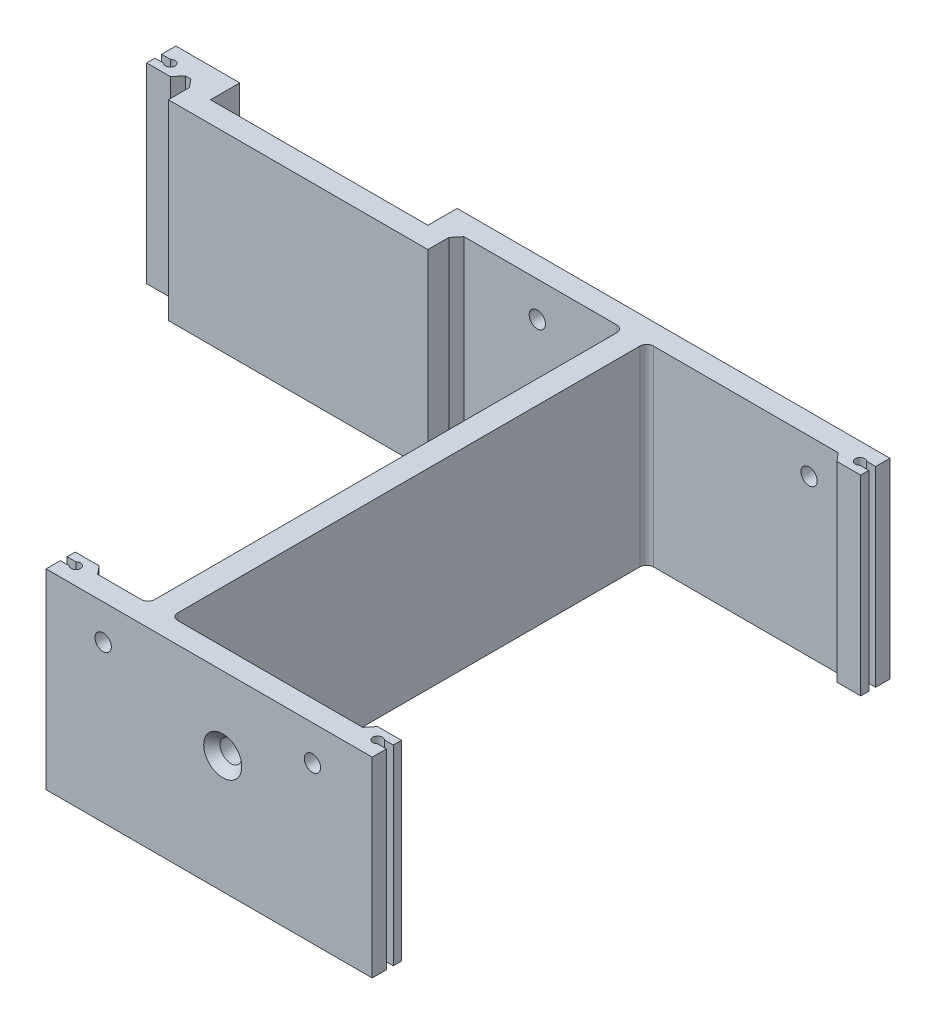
ISO-10303-21;
HEADER;
FILE_DESCRIPTION(('STEP AP214'),'2;1');
FILE_NAME('part.step','',(''),(''),'','','');
FILE_SCHEMA(('AUTOMOTIVE_DESIGN { 1 0 10303 214 1 1 1 1 }'));
ENDSEC;
DATA;
#1=APPLICATION_CONTEXT('core data for automotive mechanical design processes');
#2=APPLICATION_PROTOCOL_DEFINITION('international standard','automotive_design',2000,#1);
#3=PRODUCT_CONTEXT('',#1,'mechanical');
#4=PRODUCT('Part','Part','',(#3));
#5=PRODUCT_RELATED_PRODUCT_CATEGORY('part','',(#4));
#6=PRODUCT_DEFINITION_FORMATION('','',#4);
#7=PRODUCT_DEFINITION_CONTEXT('part definition',#1,'design');
#8=PRODUCT_DEFINITION('design','',#6,#7);
#9=PRODUCT_DEFINITION_SHAPE('','',#8);
#10=(LENGTH_UNIT() NAMED_UNIT(*) SI_UNIT(.MILLI.,.METRE.));
#11=(NAMED_UNIT(*) PLANE_ANGLE_UNIT() SI_UNIT($,.RADIAN.));
#12=(NAMED_UNIT(*) SI_UNIT($,.STERADIAN.) SOLID_ANGLE_UNIT());
#13=UNCERTAINTY_MEASURE_WITH_UNIT(LENGTH_MEASURE(1.E-05),#10,'distance_accuracy_value','');
#14=(GEOMETRIC_REPRESENTATION_CONTEXT(3) GLOBAL_UNCERTAINTY_ASSIGNED_CONTEXT((#13)) GLOBAL_UNIT_ASSIGNED_CONTEXT((#10,
#11,#12)) REPRESENTATION_CONTEXT('',''));
#15=CARTESIAN_POINT('',(0.,0.,0.));
#16=DIRECTION('',(0.,0.,1.));
#17=DIRECTION('',(1.,0.,0.));
#18=AXIS2_PLACEMENT_3D('',#15,#16,#17);
#19=CARTESIAN_POINT('',(3.2,23.,-31.6058874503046));
#20=DIRECTION('',(0.,0.,-1.));
#21=DIRECTION('',(-1.,0.,0.));
#22=AXIS2_PLACEMENT_3D('',#19,#20,#21);
#23=CYLINDRICAL_SURFACE('',#22,1.2);
#24=CARTESIAN_POINT('',(3.2,23.,-38.1));
#25=DIRECTION('',(0.,0.,-1.));
#26=DIRECTION('',(-1.,0.,0.));
#27=AXIS2_PLACEMENT_3D('',#24,#25,#26);
#28=CIRCLE('',#27,1.2);
#29=CARTESIAN_POINT('',(2.,23.,-38.1));
#30=VERTEX_POINT('',#29);
#31=EDGE_CURVE('E27',#30,#30,#28,.T.);
#32=ORIENTED_EDGE('',*,*,#31,.T.);
#33=EDGE_LOOP('',(#32));
#34=FACE_BOUND('',#33,.T.);
#35=CARTESIAN_POINT('',(3.2,23.,-35.));
#36=DIRECTION('',(0.,0.,1.));
#37=DIRECTION('',(-1.,0.,0.));
#38=AXIS2_PLACEMENT_3D('',#35,#36,#37);
#39=CIRCLE('',#38,1.2);
#40=CARTESIAN_POINT('',(2.,23.,-35.));
#41=VERTEX_POINT('',#40);
#42=EDGE_CURVE('E11',#41,#41,#39,.T.);
#43=ORIENTED_EDGE('',*,*,#42,.T.);
#44=EDGE_LOOP('',(#43));
#45=FACE_BOUND('',#44,.T.);
#46=ADVANCED_FACE('F17',(#34,#45),#23,.F.);
#47=CARTESIAN_POINT('',(43.2,23.,-31.6058874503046));
#48=DIRECTION('',(0.,0.,-1.));
#49=DIRECTION('',(-1.,0.,0.));
#50=AXIS2_PLACEMENT_3D('',#47,#48,#49);
#51=CYLINDRICAL_SURFACE('',#50,1.2);
#52=CARTESIAN_POINT('',(43.2,23.,-38.1));
#53=DIRECTION('',(0.,0.,-1.));
#54=DIRECTION('',(-1.,0.,0.));
#55=AXIS2_PLACEMENT_3D('',#52,#53,#54);
#56=CIRCLE('',#55,1.2);
#57=CARTESIAN_POINT('',(42.,23.,-38.1));
#58=VERTEX_POINT('',#57);
#59=EDGE_CURVE('E1570',#58,#58,#56,.T.);
#60=ORIENTED_EDGE('',*,*,#59,.T.);
#61=EDGE_LOOP('',(#60));
#62=FACE_BOUND('',#61,.T.);
#63=CARTESIAN_POINT('',(43.2,23.,-35.));
#64=DIRECTION('',(0.,0.,1.));
#65=DIRECTION('',(-1.,0.,0.));
#66=AXIS2_PLACEMENT_3D('',#63,#64,#65);
#67=CIRCLE('',#66,1.2);
#68=CARTESIAN_POINT('',(42.,23.,-35.));
#69=VERTEX_POINT('',#68);
#70=EDGE_CURVE('E1568',#69,#69,#67,.T.);
#71=ORIENTED_EDGE('',*,*,#70,.T.);
#72=EDGE_LOOP('',(#71));
#73=FACE_BOUND('',#72,.T.);
#74=ADVANCED_FACE('F940',(#62,#73),#51,.F.);
#75=CARTESIAN_POINT('',(30.,17.33,36.9));
#76=DIRECTION('',(0.,0.,1.));
#77=DIRECTION('',(1.,0.,0.));
#78=AXIS2_PLACEMENT_3D('',#75,#76,#77);
#79=CONICAL_SURFACE('',#78,1.6,0.785398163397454);
#80=CARTESIAN_POINT('',(30.,17.33,38.1));
#81=DIRECTION('',(0.,0.,-1.));
#82=DIRECTION('',(-1.,0.,0.));
#83=AXIS2_PLACEMENT_3D('',#80,#81,#82);
#84=CIRCLE('',#83,2.8);
#85=CARTESIAN_POINT('',(27.2,17.33,38.1));
#86=VERTEX_POINT('',#85);
#87=EDGE_CURVE('E535',#86,#86,#84,.T.);
#88=ORIENTED_EDGE('',*,*,#87,.F.);
#89=EDGE_LOOP('',(#88));
#90=FACE_BOUND('',#89,.T.);
#91=CARTESIAN_POINT('',(30.,17.33,36.9));
#92=DIRECTION('',(0.,0.,1.));
#93=DIRECTION('',(-1.,0.,0.));
#94=AXIS2_PLACEMENT_3D('',#91,#92,#93);
#95=CIRCLE('',#94,1.6);
#96=CARTESIAN_POINT('',(28.4,17.33,36.9));
#97=VERTEX_POINT('',#96);
#98=EDGE_CURVE('E1577',#97,#97,#95,.T.);
#99=ORIENTED_EDGE('',*,*,#98,.F.);
#100=EDGE_LOOP('',(#99));
#101=FACE_BOUND('',#100,.T.);
#102=ADVANCED_FACE('F946',(#90,#101),#79,.F.);
#103=CARTESIAN_POINT('',(30.,17.33,30.4745166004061));
#104=DIRECTION('',(0.,0.,1.));
#105=DIRECTION('',(1.,0.,0.));
#106=AXIS2_PLACEMENT_3D('',#103,#104,#105);
#107=CYLINDRICAL_SURFACE('',#106,1.6);
#108=ORIENTED_EDGE('',*,*,#98,.T.);
#109=EDGE_LOOP('',(#108));
#110=FACE_BOUND('',#109,.T.);
#111=CARTESIAN_POINT('',(30.,17.33,35.));
#112=DIRECTION('',(0.,0.,-1.));
#113=DIRECTION('',(1.,0.,0.));
#114=AXIS2_PLACEMENT_3D('',#111,#112,#113);
#115=CIRCLE('',#114,1.6);
#116=CARTESIAN_POINT('',(31.6,17.33,35.));
#117=VERTEX_POINT('',#116);
#118=EDGE_CURVE('E1574',#117,#117,#115,.T.);
#119=ORIENTED_EDGE('',*,*,#118,.T.);
#120=EDGE_LOOP('',(#119));
#121=FACE_BOUND('',#120,.T.);
#122=ADVANCED_FACE('F954',(#110,#121),#107,.F.);
#123=CARTESIAN_POINT('',(43.2,23.,30.4745166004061));
#124=DIRECTION('',(0.,0.,1.));
#125=DIRECTION('',(1.,0.,0.));
#126=AXIS2_PLACEMENT_3D('',#123,#124,#125);
#127=CYLINDRICAL_SURFACE('',#126,1.2);
#128=CARTESIAN_POINT('',(43.2,23.,38.1));
#129=DIRECTION('',(0.,0.,1.));
#130=DIRECTION('',(1.,0.,0.));
#131=AXIS2_PLACEMENT_3D('',#128,#129,#130);
#132=CIRCLE('',#131,1.2);
#133=CARTESIAN_POINT('',(44.4,23.,38.1));
#134=VERTEX_POINT('',#133);
#135=EDGE_CURVE('E1587',#134,#134,#132,.T.);
#136=ORIENTED_EDGE('',*,*,#135,.T.);
#137=EDGE_LOOP('',(#136));
#138=FACE_BOUND('',#137,.T.);
#139=CARTESIAN_POINT('',(43.2,23.,35.));
#140=DIRECTION('',(0.,0.,-1.));
#141=DIRECTION('',(1.,0.,0.));
#142=AXIS2_PLACEMENT_3D('',#139,#140,#141);
#143=CIRCLE('',#142,1.2);
#144=CARTESIAN_POINT('',(44.4,23.,35.));
#145=VERTEX_POINT('',#144);
#146=EDGE_CURVE('E1580',#145,#145,#143,.T.);
#147=ORIENTED_EDGE('',*,*,#146,.T.);
#148=EDGE_LOOP('',(#147));
#149=FACE_BOUND('',#148,.T.);
#150=ADVANCED_FACE('F958',(#138,#149),#127,.F.);
#151=CARTESIAN_POINT('',(12.4,23.,30.4745166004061));
#152=DIRECTION('',(0.,0.,1.));
#153=DIRECTION('',(1.,0.,0.));
#154=AXIS2_PLACEMENT_3D('',#151,#152,#153);
#155=CYLINDRICAL_SURFACE('',#154,1.2);
#156=CARTESIAN_POINT('',(12.4,23.,38.1));
#157=DIRECTION('',(0.,0.,1.));
#158=DIRECTION('',(1.,0.,0.));
#159=AXIS2_PLACEMENT_3D('',#156,#157,#158);
#160=CIRCLE('',#159,1.2);
#161=CARTESIAN_POINT('',(13.6,23.,38.1));
#162=VERTEX_POINT('',#161);
#163=EDGE_CURVE('E918',#162,#162,#160,.T.);
#164=ORIENTED_EDGE('',*,*,#163,.T.);
#165=EDGE_LOOP('',(#164));
#166=FACE_BOUND('',#165,.T.);
#167=CARTESIAN_POINT('',(12.4,23.,35.));
#168=DIRECTION('',(0.,0.,-1.));
#169=DIRECTION('',(1.,0.,0.));
#170=AXIS2_PLACEMENT_3D('',#167,#168,#169);
#171=CIRCLE('',#170,1.2);
#172=CARTESIAN_POINT('',(13.6,23.,35.));
#173=VERTEX_POINT('',#172);
#174=EDGE_CURVE('E1589',#173,#173,#171,.T.);
#175=ORIENTED_EDGE('',*,*,#174,.T.);
#176=EDGE_LOOP('',(#175));
#177=FACE_BOUND('',#176,.T.);
#178=ADVANCED_FACE('F962',(#166,#177),#155,.F.);
#179=CARTESIAN_POINT('',(50.2,28.15,-35.5));
#180=DIRECTION('',(0.,-1.,0.));
#181=DIRECTION('',(0.,0.,-1.));
#182=AXIS2_PLACEMENT_3D('',#179,#180,#181);
#183=CYLINDRICAL_SURFACE('',#182,0.699999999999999);
#184=CARTESIAN_POINT('',(50.2,28.15,-35.5));
#185=DIRECTION('',(0.,-1.,0.));
#186=DIRECTION('',(0.,0.,1.));
#187=AXIS2_PLACEMENT_3D('',#184,#185,#186);
#188=CIRCLE('',#187,0.699999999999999);
#189=CARTESIAN_POINT('',(50.6898979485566,28.15,-35.));
#190=VERTEX_POINT('',#189);
#191=CARTESIAN_POINT('',(50.6898979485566,28.15,-36.));
#192=VERTEX_POINT('',#191);
#193=EDGE_CURVE('E662',#190,#192,#188,.T.);
#194=ORIENTED_EDGE('',*,*,#193,.F.);
#195=DIRECTION('',(0.,-1.,0.));
#196=VECTOR('',#195,1.);
#197=CARTESIAN_POINT('',(50.6898979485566,28.15,-35.));
#198=LINE('',#197,#196);
#199=CARTESIAN_POINT('',(50.6898979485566,0.,-35.));
#200=VERTEX_POINT('',#199);
#201=EDGE_CURVE('E653',#190,#200,#198,.T.);
#202=ORIENTED_EDGE('',*,*,#201,.T.);
#203=CARTESIAN_POINT('',(50.2,0.,-35.5));
#204=DIRECTION('',(0.,-1.,0.));
#205=DIRECTION('',(0.,0.,1.));
#206=AXIS2_PLACEMENT_3D('',#203,#204,#205);
#207=CIRCLE('',#206,0.699999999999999);
#208=CARTESIAN_POINT('',(50.6898979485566,0.,-36.));
#209=VERTEX_POINT('',#208);
#210=EDGE_CURVE('E36',#200,#209,#207,.T.);
#211=ORIENTED_EDGE('',*,*,#210,.T.);
#212=DIRECTION('',(0.,-1.,0.));
#213=VECTOR('',#212,1.);
#214=CARTESIAN_POINT('',(50.6898979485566,28.15,-36.));
#215=LINE('',#214,#213);
#216=EDGE_CURVE('E665',#192,#209,#215,.T.);
#217=ORIENTED_EDGE('',*,*,#216,.F.);
#218=EDGE_LOOP('',(#194,#202,#211,#217));
#219=FACE_BOUND('',#218,.T.);
#220=ADVANCED_FACE('F913',(#219),#183,.F.);
#221=CARTESIAN_POINT('',(50.2,28.15,35.5));
#222=DIRECTION('',(0.,-1.,0.));
#223=DIRECTION('',(0.,0.,-1.));
#224=AXIS2_PLACEMENT_3D('',#221,#222,#223);
#225=CYLINDRICAL_SURFACE('',#224,0.699999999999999);
#226=CARTESIAN_POINT('',(50.2,28.15,35.5));
#227=DIRECTION('',(0.,-1.,0.));
#228=DIRECTION('',(0.,0.,-1.));
#229=AXIS2_PLACEMENT_3D('',#226,#227,#228);
#230=CIRCLE('',#229,0.699999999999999);
#231=CARTESIAN_POINT('',(50.6898979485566,28.15,36.));
#232=VERTEX_POINT('',#231);
#233=CARTESIAN_POINT('',(50.6898979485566,28.15,35.));
#234=VERTEX_POINT('',#233);
#235=EDGE_CURVE('E568',#232,#234,#230,.T.);
#236=ORIENTED_EDGE('',*,*,#235,.F.);
#237=DIRECTION('',(0.,-1.,0.));
#238=VECTOR('',#237,1.);
#239=CARTESIAN_POINT('',(50.6898979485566,28.15,36.));
#240=LINE('',#239,#238);
#241=CARTESIAN_POINT('',(50.6898979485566,0.,36.));
#242=VERTEX_POINT('',#241);
#243=EDGE_CURVE('E558',#232,#242,#240,.T.);
#244=ORIENTED_EDGE('',*,*,#243,.T.);
#245=CARTESIAN_POINT('',(50.2,0.,35.5));
#246=DIRECTION('',(0.,-1.,0.));
#247=DIRECTION('',(0.,0.,-1.));
#248=AXIS2_PLACEMENT_3D('',#245,#246,#247);
#249=CIRCLE('',#248,0.699999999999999);
#250=CARTESIAN_POINT('',(50.6898979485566,0.,35.));
#251=VERTEX_POINT('',#250);
#252=EDGE_CURVE('E848',#242,#251,#249,.T.);
#253=ORIENTED_EDGE('',*,*,#252,.T.);
#254=DIRECTION('',(0.,-1.,0.));
#255=VECTOR('',#254,1.);
#256=CARTESIAN_POINT('',(50.6898979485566,28.15,35.));
#257=LINE('',#256,#255);
#258=EDGE_CURVE('E571',#234,#251,#257,.T.);
#259=ORIENTED_EDGE('',*,*,#258,.F.);
#260=EDGE_LOOP('',(#236,#244,#253,#259));
#261=FACE_BOUND('',#260,.T.);
#262=ADVANCED_FACE('F847',(#261),#225,.F.);
#263=CARTESIAN_POINT('',(5.80000000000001,28.15,35.5));
#264=DIRECTION('',(0.,-1.,0.));
#265=DIRECTION('',(0.,0.,-1.));
#266=AXIS2_PLACEMENT_3D('',#263,#264,#265);
#267=CYLINDRICAL_SURFACE('',#266,0.699999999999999);
#268=CARTESIAN_POINT('',(5.80000000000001,28.15,35.5));
#269=DIRECTION('',(0.,-1.,0.));
#270=DIRECTION('',(0.,0.,1.));
#271=AXIS2_PLACEMENT_3D('',#268,#269,#270);
#272=CIRCLE('',#271,0.699999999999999);
#273=CARTESIAN_POINT('',(5.31010205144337,28.15,35.));
#274=VERTEX_POINT('',#273);
#275=CARTESIAN_POINT('',(5.31010205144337,28.15,36.));
#276=VERTEX_POINT('',#275);
#277=EDGE_CURVE('E528',#274,#276,#272,.T.);
#278=ORIENTED_EDGE('',*,*,#277,.F.);
#279=DIRECTION('',(0.,-1.,0.));
#280=VECTOR('',#279,1.);
#281=CARTESIAN_POINT('',(5.31010205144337,28.15,35.));
#282=LINE('',#281,#280);
#283=CARTESIAN_POINT('',(5.31010205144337,0.,35.));
#284=VERTEX_POINT('',#283);
#285=EDGE_CURVE('E518',#274,#284,#282,.T.);
#286=ORIENTED_EDGE('',*,*,#285,.T.);
#287=CARTESIAN_POINT('',(5.80000000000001,0.,35.5));
#288=DIRECTION('',(0.,-1.,0.));
#289=DIRECTION('',(0.,0.,1.));
#290=AXIS2_PLACEMENT_3D('',#287,#288,#289);
#291=CIRCLE('',#290,0.699999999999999);
#292=CARTESIAN_POINT('',(5.31010205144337,0.,36.));
#293=VERTEX_POINT('',#292);
#294=EDGE_CURVE('E717',#284,#293,#291,.T.);
#295=ORIENTED_EDGE('',*,*,#294,.T.);
#296=DIRECTION('',(0.,-1.,0.));
#297=VECTOR('',#296,1.);
#298=CARTESIAN_POINT('',(5.31010205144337,28.15,36.));
#299=LINE('',#298,#297);
#300=EDGE_CURVE('E531',#276,#293,#299,.T.);
#301=ORIENTED_EDGE('',*,*,#300,.F.);
#302=EDGE_LOOP('',(#278,#286,#295,#301));
#303=FACE_BOUND('',#302,.T.);
#304=ADVANCED_FACE('F817',(#303),#267,.F.);
#305=CARTESIAN_POINT('',(-51.3,28.15,-35.5));
#306=DIRECTION('',(0.,-1.,0.));
#307=DIRECTION('',(0.,0.,-1.));
#308=AXIS2_PLACEMENT_3D('',#305,#306,#307);
#309=CYLINDRICAL_SURFACE('',#308,0.699999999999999);
#310=CARTESIAN_POINT('',(-51.3,28.15,-35.5));
#311=DIRECTION('',(0.,-1.,0.));
#312=DIRECTION('',(0.,0.,-1.));
#313=AXIS2_PLACEMENT_3D('',#310,#311,#312);
#314=CIRCLE('',#313,0.699999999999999);
#315=CARTESIAN_POINT('',(-51.7898979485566,28.15,-36.));
#316=VERTEX_POINT('',#315);
#317=CARTESIAN_POINT('',(-51.7898979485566,28.15,-35.));
#318=VERTEX_POINT('',#317);
#319=EDGE_CURVE('E391',#316,#318,#314,.T.);
#320=ORIENTED_EDGE('',*,*,#319,.F.);
#321=DIRECTION('',(0.,-1.,0.));
#322=VECTOR('',#321,1.);
#323=CARTESIAN_POINT('',(-51.7898979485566,28.15,-36.));
#324=LINE('',#323,#322);
#325=CARTESIAN_POINT('',(-51.7898979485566,0.,-36.));
#326=VERTEX_POINT('',#325);
#327=EDGE_CURVE('E381',#316,#326,#324,.T.);
#328=ORIENTED_EDGE('',*,*,#327,.T.);
#329=CARTESIAN_POINT('',(-51.3,0.,-35.5));
#330=DIRECTION('',(0.,-1.,0.));
#331=DIRECTION('',(0.,0.,-1.));
#332=AXIS2_PLACEMENT_3D('',#329,#330,#331);
#333=CIRCLE('',#332,0.699999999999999);
#334=CARTESIAN_POINT('',(-51.7898979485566,0.,-35.));
#335=VERTEX_POINT('',#334);
#336=EDGE_CURVE('E362',#326,#335,#333,.T.);
#337=ORIENTED_EDGE('',*,*,#336,.T.);
#338=DIRECTION('',(0.,-1.,0.));
#339=VECTOR('',#338,1.);
#340=CARTESIAN_POINT('',(-51.7898979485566,28.15,-35.));
#341=LINE('',#340,#339);
#342=EDGE_CURVE('E394',#318,#335,#341,.T.);
#343=ORIENTED_EDGE('',*,*,#342,.F.);
#344=EDGE_LOOP('',(#320,#328,#337,#343));
#345=FACE_BOUND('',#344,.T.);
#346=ADVANCED_FACE('F708',(#345),#309,.F.);
#347=CARTESIAN_POINT('',(-43.7,28.15,-38.1));
#348=DIRECTION('',(-1.,0.,0.));
#349=DIRECTION('',(0.,0.,1.));
#350=AXIS2_PLACEMENT_3D('',#347,#348,#349);
#351=PLANE('',#350);
#352=DIRECTION('',(0.,0.,-1.));
#353=VECTOR('',#352,1.);
#354=CARTESIAN_POINT('',(-43.7,0.,-38.1));
#355=LINE('',#354,#353);
#356=CARTESIAN_POINT('',(-43.7,0.,-33.8));
#357=VERTEX_POINT('',#356);
#358=CARTESIAN_POINT('',(-43.7,0.,-38.1));
#359=VERTEX_POINT('',#358);
#360=EDGE_CURVE('E359',#357,#359,#355,.T.);
#361=ORIENTED_EDGE('',*,*,#360,.T.);
#362=DIRECTION('',(0.,-1.,0.));
#363=VECTOR('',#362,1.);
#364=CARTESIAN_POINT('',(-43.7,28.15,-38.1));
#365=LINE('',#364,#363);
#366=CARTESIAN_POINT('',(-43.7,28.15,-38.1));
#367=VERTEX_POINT('',#366);
#368=EDGE_CURVE('E365',#367,#359,#365,.T.);
#369=ORIENTED_EDGE('',*,*,#368,.F.);
#370=DIRECTION('',(0.,0.,-1.));
#371=VECTOR('',#370,1.);
#372=CARTESIAN_POINT('',(-43.7,28.15,-38.1));
#373=LINE('',#372,#371);
#374=CARTESIAN_POINT('',(-43.7,28.15,-33.8));
#375=VERTEX_POINT('',#374);
#376=EDGE_CURVE('E351',#375,#367,#373,.T.);
#377=ORIENTED_EDGE('',*,*,#376,.F.);
#378=DIRECTION('',(0.,-1.,0.));
#379=VECTOR('',#378,1.);
#380=CARTESIAN_POINT('',(-43.7,28.15,-33.8));
#381=LINE('',#380,#379);
#382=EDGE_CURVE('E355',#375,#357,#381,.T.);
#383=ORIENTED_EDGE('',*,*,#382,.T.);
#384=EDGE_LOOP('',(#361,#369,#377,#383));
#385=FACE_BOUND('',#384,.T.);
#386=ADVANCED_FACE('F692',(#385),#351,.F.);
#387=CARTESIAN_POINT('',(-53.1,28.15,-38.1));
#388=DIRECTION('',(0.,0.,1.));
#389=DIRECTION('',(1.,0.,0.));
#390=AXIS2_PLACEMENT_3D('',#387,#388,#389);
#391=PLANE('',#390);
#392=DIRECTION('',(-1.,0.,0.));
#393=VECTOR('',#392,1.);
#394=CARTESIAN_POINT('',(-53.1,0.,-38.1));
#395=LINE('',#394,#393);
#396=CARTESIAN_POINT('',(-53.1,0.,-38.1));
#397=VERTEX_POINT('',#396);
#398=EDGE_CURVE('E360',#359,#397,#395,.T.);
#399=ORIENTED_EDGE('',*,*,#398,.T.);
#400=DIRECTION('',(0.,-1.,0.));
#401=VECTOR('',#400,1.);
#402=CARTESIAN_POINT('',(-53.1,28.15,-38.1));
#403=LINE('',#402,#401);
#404=CARTESIAN_POINT('',(-53.1,28.15,-38.1));
#405=VERTEX_POINT('',#404);
#406=EDGE_CURVE('E370',#405,#397,#403,.T.);
#407=ORIENTED_EDGE('',*,*,#406,.F.);
#408=DIRECTION('',(-1.,0.,0.));
#409=VECTOR('',#408,1.);
#410=CARTESIAN_POINT('',(-53.1,28.15,-38.1));
#411=LINE('',#410,#409);
#412=EDGE_CURVE('E374',#367,#405,#411,.T.);
#413=ORIENTED_EDGE('',*,*,#412,.F.);
#414=ORIENTED_EDGE('',*,*,#368,.T.);
#415=EDGE_LOOP('',(#399,#407,#413,#414));
#416=FACE_BOUND('',#415,.T.);
#417=ADVANCED_FACE('F696',(#416),#391,.F.);
#418=CARTESIAN_POINT('',(-53.1,28.15,-38.1));
#419=DIRECTION('',(1.,0.,0.));
#420=DIRECTION('',(0.,0.,-1.));
#421=AXIS2_PLACEMENT_3D('',#418,#419,#420);
#422=PLANE('',#421);
#423=DIRECTION('',(0.,0.,1.));
#424=VECTOR('',#423,1.);
#425=CARTESIAN_POINT('',(-53.1,0.,-38.1));
#426=LINE('',#425,#424);
#427=CARTESIAN_POINT('',(-53.1,0.,-36.));
#428=VERTEX_POINT('',#427);
#429=EDGE_CURVE('E372',#397,#428,#426,.T.);
#430=ORIENTED_EDGE('',*,*,#429,.T.);
#431=DIRECTION('',(0.,-1.,0.));
#432=VECTOR('',#431,1.);
#433=CARTESIAN_POINT('',(-53.1,28.15,-36.));
#434=LINE('',#433,#432);
#435=CARTESIAN_POINT('',(-53.1,28.15,-36.));
#436=VERTEX_POINT('',#435);
#437=EDGE_CURVE('E379',#436,#428,#434,.T.);
#438=ORIENTED_EDGE('',*,*,#437,.F.);
#439=DIRECTION('',(0.,0.,1.));
#440=VECTOR('',#439,1.);
#441=CARTESIAN_POINT('',(-53.1,28.15,-38.1));
#442=LINE('',#441,#440);
#443=EDGE_CURVE('E376',#405,#436,#442,.T.);
#444=ORIENTED_EDGE('',*,*,#443,.F.);
#445=ORIENTED_EDGE('',*,*,#406,.T.);
#446=EDGE_LOOP('',(#430,#438,#444,#445));
#447=FACE_BOUND('',#446,.T.);
#448=ADVANCED_FACE('F702',(#447),#422,.F.);
#449=CARTESIAN_POINT('',(-53.1,28.15,-36.));
#450=DIRECTION('',(0.,0.,-1.));
#451=DIRECTION('',(-1.,0.,0.));
#452=AXIS2_PLACEMENT_3D('',#449,#450,#451);
#453=PLANE('',#452);
#454=DIRECTION('',(1.,0.,0.));
#455=VECTOR('',#454,1.);
#456=CARTESIAN_POINT('',(-53.1,0.,-36.));
#457=LINE('',#456,#455);
#458=EDGE_CURVE('E373',#428,#326,#457,.T.);
#459=ORIENTED_EDGE('',*,*,#458,.T.);
#460=ORIENTED_EDGE('',*,*,#327,.F.);
#461=DIRECTION('',(1.,0.,0.));
#462=VECTOR('',#461,1.);
#463=CARTESIAN_POINT('',(-53.1,28.15,-36.));
#464=LINE('',#463,#462);
#465=EDGE_CURVE('E383',#436,#316,#464,.T.);
#466=ORIENTED_EDGE('',*,*,#465,.F.);
#467=ORIENTED_EDGE('',*,*,#437,.T.);
#468=EDGE_LOOP('',(#459,#460,#466,#467));
#469=FACE_BOUND('',#468,.T.);
#470=ADVANCED_FACE('F705',(#469),#453,.F.);
#471=CARTESIAN_POINT('',(-51.7898979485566,28.15,-35.));
#472=DIRECTION('',(0.,0.,1.));
#473=DIRECTION('',(1.,0.,0.));
#474=AXIS2_PLACEMENT_3D('',#471,#472,#473);
#475=PLANE('',#474);
#476=DIRECTION('',(-1.,0.,0.));
#477=VECTOR('',#476,1.);
#478=CARTESIAN_POINT('',(-51.7898979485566,0.,-35.));
#479=LINE('',#478,#477);
#480=CARTESIAN_POINT('',(-53.1,0.,-35.));
#481=VERTEX_POINT('',#480);
#482=EDGE_CURVE('E388',#335,#481,#479,.T.);
#483=ORIENTED_EDGE('',*,*,#482,.T.);
#484=DIRECTION('',(0.,-1.,0.));
#485=VECTOR('',#484,1.);
#486=CARTESIAN_POINT('',(-53.1,28.15,-35.));
#487=LINE('',#486,#485);
#488=CARTESIAN_POINT('',(-53.1,28.15,-35.));
#489=VERTEX_POINT('',#488);
#490=EDGE_CURVE('E395',#489,#481,#487,.T.);
#491=ORIENTED_EDGE('',*,*,#490,.F.);
#492=DIRECTION('',(-1.,0.,0.));
#493=VECTOR('',#492,1.);
#494=CARTESIAN_POINT('',(-51.7898979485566,28.15,-35.));
#495=LINE('',#494,#493);
#496=EDGE_CURVE('E399',#318,#489,#495,.T.);
#497=ORIENTED_EDGE('',*,*,#496,.F.);
#498=ORIENTED_EDGE('',*,*,#342,.T.);
#499=EDGE_LOOP('',(#483,#491,#497,#498));
#500=FACE_BOUND('',#499,.T.);
#501=ADVANCED_FACE('F719',(#500),#475,.F.);
#502=CARTESIAN_POINT('',(-53.1,28.15,-35.));
#503=DIRECTION('',(1.,0.,0.));
#504=DIRECTION('',(0.,0.,-1.));
#505=AXIS2_PLACEMENT_3D('',#502,#503,#504);
#506=PLANE('',#505);
#507=DIRECTION('',(0.,0.,1.));
#508=VECTOR('',#507,1.);
#509=CARTESIAN_POINT('',(-53.1,0.,-35.));
#510=LINE('',#509,#508);
#511=CARTESIAN_POINT('',(-53.1,0.,-33.8));
#512=VERTEX_POINT('',#511);
#513=EDGE_CURVE('E397',#481,#512,#510,.T.);
#514=ORIENTED_EDGE('',*,*,#513,.T.);
#515=DIRECTION('',(0.,-1.,0.));
#516=VECTOR('',#515,1.);
#517=CARTESIAN_POINT('',(-53.1,28.15,-33.8));
#518=LINE('',#517,#516);
#519=CARTESIAN_POINT('',(-53.1,28.15,-33.8));
#520=VERTEX_POINT('',#519);
#521=EDGE_CURVE('E404',#520,#512,#518,.T.);
#522=ORIENTED_EDGE('',*,*,#521,.F.);
#523=DIRECTION('',(0.,0.,1.));
#524=VECTOR('',#523,1.);
#525=CARTESIAN_POINT('',(-53.1,28.15,-35.));
#526=LINE('',#525,#524);
#527=EDGE_CURVE('E401',#489,#520,#526,.T.);
#528=ORIENTED_EDGE('',*,*,#527,.F.);
#529=ORIENTED_EDGE('',*,*,#490,.T.);
#530=EDGE_LOOP('',(#514,#522,#528,#529));
#531=FACE_BOUND('',#530,.T.);
#532=ADVANCED_FACE('F727',(#531),#506,.F.);
#533=CARTESIAN_POINT('',(-53.1,28.15,-33.8));
#534=DIRECTION('',(0.,0.,-1.));
#535=DIRECTION('',(-1.,0.,0.));
#536=AXIS2_PLACEMENT_3D('',#533,#534,#535);
#537=PLANE('',#536);
#538=DIRECTION('',(1.,0.,0.));
#539=VECTOR('',#538,1.);
#540=CARTESIAN_POINT('',(-53.1,0.,-33.8));
#541=LINE('',#540,#539);
#542=CARTESIAN_POINT('',(-49.6,0.,-33.8));
#543=VERTEX_POINT('',#542);
#544=EDGE_CURVE('E398',#512,#543,#541,.T.);
#545=ORIENTED_EDGE('',*,*,#544,.T.);
#546=DIRECTION('',(0.,-1.,0.));
#547=VECTOR('',#546,1.);
#548=CARTESIAN_POINT('',(-49.6,28.15,-33.8));
#549=LINE('',#548,#547);
#550=CARTESIAN_POINT('',(-49.6,28.15,-33.8));
#551=VERTEX_POINT('',#550);
#552=EDGE_CURVE('E411',#551,#543,#549,.T.);
#553=ORIENTED_EDGE('',*,*,#552,.F.);
#554=DIRECTION('',(1.,0.,0.));
#555=VECTOR('',#554,1.);
#556=CARTESIAN_POINT('',(-53.1,28.15,-33.8));
#557=LINE('',#556,#555);
#558=EDGE_CURVE('E408',#520,#551,#557,.T.);
#559=ORIENTED_EDGE('',*,*,#558,.F.);
#560=ORIENTED_EDGE('',*,*,#521,.T.);
#561=EDGE_LOOP('',(#545,#553,#559,#560));
#562=FACE_BOUND('',#561,.T.);
#563=ADVANCED_FACE('F730',(#562),#537,.F.);
#564=CARTESIAN_POINT('',(-49.6,28.15,-33.8));
#565=DIRECTION('',(-0.768221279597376,0.,-0.64018439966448));
#566=DIRECTION('',(-0.64018439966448,0.,0.768221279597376));
#567=AXIS2_PLACEMENT_3D('',#564,#565,#566);
#568=PLANE('',#567);
#569=DIRECTION('',(0.64018439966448,0.,-0.768221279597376));
#570=VECTOR('',#569,1.);
#571=CARTESIAN_POINT('',(-49.6,0.,-33.8));
#572=LINE('',#571,#570);
#573=CARTESIAN_POINT('',(-48.6,0.,-35.));
#574=VERTEX_POINT('',#573);
#575=EDGE_CURVE('E406',#543,#574,#572,.T.);
#576=ORIENTED_EDGE('',*,*,#575,.T.);
#577=DIRECTION('',(0.,-1.,0.));
#578=VECTOR('',#577,1.);
#579=CARTESIAN_POINT('',(-48.6,28.15,-35.));
#580=LINE('',#579,#578);
#581=CARTESIAN_POINT('',(-48.6,28.15,-35.));
#582=VERTEX_POINT('',#581);
#583=EDGE_CURVE('E418',#582,#574,#580,.T.);
#584=ORIENTED_EDGE('',*,*,#583,.F.);
#585=DIRECTION('',(0.64018439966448,0.,-0.768221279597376));
#586=VECTOR('',#585,1.);
#587=CARTESIAN_POINT('',(-49.6,28.15,-33.8));
#588=LINE('',#587,#586);
#589=EDGE_CURVE('E415',#551,#582,#588,.T.);
#590=ORIENTED_EDGE('',*,*,#589,.F.);
#591=ORIENTED_EDGE('',*,*,#552,.T.);
#592=EDGE_LOOP('',(#576,#584,#590,#591));
#593=FACE_BOUND('',#592,.T.);
#594=ADVANCED_FACE('F735',(#593),#568,.F.);
#595=CARTESIAN_POINT('',(-47.8,28.15,-35.));
#596=DIRECTION('',(0.,0.,-1.));
#597=DIRECTION('',(-1.,0.,0.));
#598=AXIS2_PLACEMENT_3D('',#595,#596,#597);
#599=PLANE('',#598);
#600=DIRECTION('',(1.,0.,0.));
#601=VECTOR('',#600,1.);
#602=CARTESIAN_POINT('',(-47.8,0.,-35.));
#603=LINE('',#602,#601);
#604=CARTESIAN_POINT('',(-47.8,0.,-35.));
#605=VERTEX_POINT('',#604);
#606=EDGE_CURVE('E413',#574,#605,#603,.T.);
#607=ORIENTED_EDGE('',*,*,#606,.T.);
#608=DIRECTION('',(0.,-1.,0.));
#609=VECTOR('',#608,1.);
#610=CARTESIAN_POINT('',(-47.8,28.15,-35.));
#611=LINE('',#610,#609);
#612=CARTESIAN_POINT('',(-47.8,28.15,-35.));
#613=VERTEX_POINT('',#612);
#614=EDGE_CURVE('E425',#613,#605,#611,.T.);
#615=ORIENTED_EDGE('',*,*,#614,.F.);
#616=DIRECTION('',(1.,0.,0.));
#617=VECTOR('',#616,1.);
#618=CARTESIAN_POINT('',(-47.8,28.15,-35.));
#619=LINE('',#618,#617);
#620=EDGE_CURVE('E422',#582,#613,#619,.T.);
#621=ORIENTED_EDGE('',*,*,#620,.F.);
#622=ORIENTED_EDGE('',*,*,#583,.T.);
#623=EDGE_LOOP('',(#607,#615,#621,#622));
#624=FACE_BOUND('',#623,.T.);
#625=ADVANCED_FACE('F741',(#624),#599,.F.);
#626=CARTESIAN_POINT('',(-47.8,28.15,-35.));
#627=DIRECTION('',(0.768221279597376,0.,-0.64018439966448));
#628=DIRECTION('',(-0.64018439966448,0.,-0.768221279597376));
#629=AXIS2_PLACEMENT_3D('',#626,#627,#628);
#630=PLANE('',#629);
#631=DIRECTION('',(0.64018439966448,0.,0.768221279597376));
#632=VECTOR('',#631,1.);
#633=CARTESIAN_POINT('',(-47.8,0.,-35.));
#634=LINE('',#633,#632);
#635=CARTESIAN_POINT('',(-46.8,0.,-33.8));
#636=VERTEX_POINT('',#635);
#637=EDGE_CURVE('E420',#605,#636,#634,.T.);
#638=ORIENTED_EDGE('',*,*,#637,.T.);
#639=DIRECTION('',(0.,-1.,0.));
#640=VECTOR('',#639,1.);
#641=CARTESIAN_POINT('',(-46.8,28.15,-33.8));
#642=LINE('',#641,#640);
#643=CARTESIAN_POINT('',(-46.8,28.15,-33.8));
#644=VERTEX_POINT('',#643);
#645=EDGE_CURVE('E432',#644,#636,#642,.T.);
#646=ORIENTED_EDGE('',*,*,#645,.F.);
#647=DIRECTION('',(0.64018439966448,0.,0.768221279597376));
#648=VECTOR('',#647,1.);
#649=CARTESIAN_POINT('',(-47.8,28.15,-35.));
#650=LINE('',#649,#648);
#651=EDGE_CURVE('E429',#613,#644,#650,.T.);
#652=ORIENTED_EDGE('',*,*,#651,.F.);
#653=ORIENTED_EDGE('',*,*,#614,.T.);
#654=EDGE_LOOP('',(#638,#646,#652,#653));
#655=FACE_BOUND('',#654,.T.);
#656=ADVANCED_FACE('F745',(#655),#630,.F.);
#657=CARTESIAN_POINT('',(-46.8,28.15,-30.7));
#658=DIRECTION('',(1.,0.,0.));
#659=DIRECTION('',(0.,0.,-1.));
#660=AXIS2_PLACEMENT_3D('',#657,#658,#659);
#661=PLANE('',#660);
#662=DIRECTION('',(0.,0.,1.));
#663=VECTOR('',#662,1.);
#664=CARTESIAN_POINT('',(-46.8,0.,-30.7));
#665=LINE('',#664,#663);
#666=CARTESIAN_POINT('',(-46.8,0.,-30.7));
#667=VERTEX_POINT('',#666);
#668=EDGE_CURVE('E427',#636,#667,#665,.T.);
#669=ORIENTED_EDGE('',*,*,#668,.T.);
#670=DIRECTION('',(0.,-1.,0.));
#671=VECTOR('',#670,1.);
#672=CARTESIAN_POINT('',(-46.8,28.15,-30.7));
#673=LINE('',#672,#671);
#674=CARTESIAN_POINT('',(-46.8,28.15,-30.7));
#675=VERTEX_POINT('',#674);
#676=EDGE_CURVE('E439',#675,#667,#673,.T.);
#677=ORIENTED_EDGE('',*,*,#676,.F.);
#678=DIRECTION('',(0.,0.,1.));
#679=VECTOR('',#678,1.);
#680=CARTESIAN_POINT('',(-46.8,28.15,-30.7));
#681=LINE('',#680,#679);
#682=EDGE_CURVE('E436',#644,#675,#681,.T.);
#683=ORIENTED_EDGE('',*,*,#682,.F.);
#684=ORIENTED_EDGE('',*,*,#645,.T.);
#685=EDGE_LOOP('',(#669,#677,#683,#684));
#686=FACE_BOUND('',#685,.T.);
#687=ADVANCED_FACE('F750',(#686),#661,.F.);
#688=CARTESIAN_POINT('',(-8.60000000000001,28.15,-30.7));
#689=DIRECTION('',(0.,0.,-1.));
#690=DIRECTION('',(-1.,0.,0.));
#691=AXIS2_PLACEMENT_3D('',#688,#689,#690);
#692=PLANE('',#691);
#693=DIRECTION('',(1.,0.,0.));
#694=VECTOR('',#693,1.);
#695=CARTESIAN_POINT('',(-8.60000000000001,0.,-30.7));
#696=LINE('',#695,#694);
#697=CARTESIAN_POINT('',(-8.60000000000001,0.,-30.7));
#698=VERTEX_POINT('',#697);
#699=EDGE_CURVE('E434',#667,#698,#696,.T.);
#700=ORIENTED_EDGE('',*,*,#699,.T.);
#701=DIRECTION('',(0.,-1.,0.));
#702=VECTOR('',#701,1.);
#703=CARTESIAN_POINT('',(-8.60000000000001,28.15,-30.7));
#704=LINE('',#703,#702);
#705=CARTESIAN_POINT('',(-8.60000000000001,28.15,-30.7));
#706=VERTEX_POINT('',#705);
#707=EDGE_CURVE('E446',#706,#698,#704,.T.);
#708=ORIENTED_EDGE('',*,*,#707,.F.);
#709=DIRECTION('',(1.,0.,0.));
#710=VECTOR('',#709,1.);
#711=CARTESIAN_POINT('',(-8.60000000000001,28.15,-30.7));
#712=LINE('',#711,#710);
#713=EDGE_CURVE('E443',#675,#706,#712,.T.);
#714=ORIENTED_EDGE('',*,*,#713,.F.);
#715=ORIENTED_EDGE('',*,*,#676,.T.);
#716=EDGE_LOOP('',(#700,#708,#714,#715));
#717=FACE_BOUND('',#716,.T.);
#718=ADVANCED_FACE('F756',(#717),#692,.F.);
#719=CARTESIAN_POINT('',(-8.60000000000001,28.15,-33.8));
#720=DIRECTION('',(-1.,0.,0.));
#721=DIRECTION('',(0.,0.,1.));
#722=AXIS2_PLACEMENT_3D('',#719,#720,#721);
#723=PLANE('',#722);
#724=DIRECTION('',(0.,0.,-1.));
#725=VECTOR('',#724,1.);
#726=CARTESIAN_POINT('',(-8.60000000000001,0.,-33.8));
#727=LINE('',#726,#725);
#728=CARTESIAN_POINT('',(-8.60000000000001,0.,-33.8));
#729=VERTEX_POINT('',#728);
#730=EDGE_CURVE('E441',#698,#729,#727,.T.);
#731=ORIENTED_EDGE('',*,*,#730,.T.);
#732=DIRECTION('',(0.,-1.,0.));
#733=VECTOR('',#732,1.);
#734=CARTESIAN_POINT('',(-8.60000000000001,28.15,-33.8));
#735=LINE('',#734,#733);
#736=CARTESIAN_POINT('',(-8.60000000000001,28.15,-33.8));
#737=VERTEX_POINT('',#736);
#738=EDGE_CURVE('E453',#737,#729,#735,.T.);
#739=ORIENTED_EDGE('',*,*,#738,.F.);
#740=DIRECTION('',(0.,0.,-1.));
#741=VECTOR('',#740,1.);
#742=CARTESIAN_POINT('',(-8.60000000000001,28.15,-33.8));
#743=LINE('',#742,#741);
#744=EDGE_CURVE('E450',#706,#737,#743,.T.);
#745=ORIENTED_EDGE('',*,*,#744,.F.);
#746=ORIENTED_EDGE('',*,*,#707,.T.);
#747=EDGE_LOOP('',(#731,#739,#745,#746));
#748=FACE_BOUND('',#747,.T.);
#749=ADVANCED_FACE('F760',(#748),#723,.F.);
#750=CARTESIAN_POINT('',(-7.60000000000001,28.15,-35.));
#751=DIRECTION('',(-0.768221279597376,0.,-0.64018439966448));
#752=DIRECTION('',(-0.64018439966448,0.,0.768221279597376));
#753=AXIS2_PLACEMENT_3D('',#750,#751,#752);
#754=PLANE('',#753);
#755=DIRECTION('',(0.64018439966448,0.,-0.768221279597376));
#756=VECTOR('',#755,1.);
#757=CARTESIAN_POINT('',(-7.60000000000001,0.,-35.));
#758=LINE('',#757,#756);
#759=CARTESIAN_POINT('',(-7.60000000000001,0.,-35.));
#760=VERTEX_POINT('',#759);
#761=EDGE_CURVE('E448',#729,#760,#758,.T.);
#762=ORIENTED_EDGE('',*,*,#761,.T.);
#763=DIRECTION('',(0.,-1.,0.));
#764=VECTOR('',#763,1.);
#765=CARTESIAN_POINT('',(-7.60000000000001,28.15,-35.));
#766=LINE('',#765,#764);
#767=CARTESIAN_POINT('',(-7.60000000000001,28.15,-35.));
#768=VERTEX_POINT('',#767);
#769=EDGE_CURVE('E460',#768,#760,#766,.T.);
#770=ORIENTED_EDGE('',*,*,#769,.F.);
#771=DIRECTION('',(0.64018439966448,0.,-0.768221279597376));
#772=VECTOR('',#771,1.);
#773=CARTESIAN_POINT('',(-7.60000000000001,28.15,-35.));
#774=LINE('',#773,#772);
#775=EDGE_CURVE('E457',#737,#768,#774,.T.);
#776=ORIENTED_EDGE('',*,*,#775,.F.);
#777=ORIENTED_EDGE('',*,*,#738,.T.);
#778=EDGE_LOOP('',(#762,#770,#776,#777));
#779=FACE_BOUND('',#778,.T.);
#780=ADVANCED_FACE('F765',(#779),#754,.F.);
#781=CARTESIAN_POINT('',(14.9,28.15,-35.));
#782=DIRECTION('',(0.,0.,-1.));
#783=DIRECTION('',(-1.,0.,0.));
#784=AXIS2_PLACEMENT_3D('',#781,#782,#783);
#785=PLANE('',#784);
#786=ORIENTED_EDGE('',*,*,#42,.F.);
#787=EDGE_LOOP('',(#786));
#788=FACE_BOUND('',#787,.T.);
#789=DIRECTION('',(1.,0.,0.));
#790=VECTOR('',#789,1.);
#791=CARTESIAN_POINT('',(14.9,0.,-35.));
#792=LINE('',#791,#790);
#793=CARTESIAN_POINT('',(14.9,0.,-35.));
#794=VERTEX_POINT('',#793);
#795=EDGE_CURVE('E455',#760,#794,#792,.T.);
#796=ORIENTED_EDGE('',*,*,#795,.T.);
#797=DIRECTION('',(0.,-1.,0.));
#798=VECTOR('',#797,1.);
#799=CARTESIAN_POINT('',(14.9,28.15,-35.));
#800=LINE('',#799,#798);
#801=CARTESIAN_POINT('',(14.9,28.15,-35.));
#802=VERTEX_POINT('',#801);
#803=EDGE_CURVE('E467',#802,#794,#800,.T.);
#804=ORIENTED_EDGE('',*,*,#803,.F.);
#805=DIRECTION('',(1.,0.,0.));
#806=VECTOR('',#805,1.);
#807=CARTESIAN_POINT('',(14.9,28.15,-35.));
#808=LINE('',#807,#806);
#809=EDGE_CURVE('E464',#768,#802,#808,.T.);
#810=ORIENTED_EDGE('',*,*,#809,.F.);
#811=ORIENTED_EDGE('',*,*,#769,.T.);
#812=EDGE_LOOP('',(#796,#804,#810,#811));
#813=FACE_BOUND('',#812,.T.);
#814=ADVANCED_FACE('F771',(#788,#813),#785,.F.);
#815=CARTESIAN_POINT('',(14.9,28.15,-34.));
#816=DIRECTION('',(0.,-1.,0.));
#817=DIRECTION('',(0.,0.,-1.));
#818=AXIS2_PLACEMENT_3D('',#815,#816,#817);
#819=CYLINDRICAL_SURFACE('',#818,1.);
#820=CARTESIAN_POINT('',(14.9,0.,-34.));
#821=DIRECTION('',(0.,-1.,0.));
#822=DIRECTION('',(0.,0.,1.));
#823=AXIS2_PLACEMENT_3D('',#820,#821,#822);
#824=CIRCLE('',#823,1.);
#825=CARTESIAN_POINT('',(15.9,0.,-34.));
#826=VERTEX_POINT('',#825);
#827=EDGE_CURVE('E462',#794,#826,#824,.T.);
#828=ORIENTED_EDGE('',*,*,#827,.T.);
#829=DIRECTION('',(0.,-1.,0.));
#830=VECTOR('',#829,1.);
#831=CARTESIAN_POINT('',(15.9,28.15,-34.));
#832=LINE('',#831,#830);
#833=CARTESIAN_POINT('',(15.9,28.15,-34.));
#834=VERTEX_POINT('',#833);
#835=EDGE_CURVE('E474',#834,#826,#832,.T.);
#836=ORIENTED_EDGE('',*,*,#835,.F.);
#837=CARTESIAN_POINT('',(14.9,28.15,-34.));
#838=DIRECTION('',(0.,-1.,0.));
#839=DIRECTION('',(0.,0.,1.));
#840=AXIS2_PLACEMENT_3D('',#837,#838,#839);
#841=CIRCLE('',#840,1.);
#842=EDGE_CURVE('E471',#802,#834,#841,.T.);
#843=ORIENTED_EDGE('',*,*,#842,.F.);
#844=ORIENTED_EDGE('',*,*,#803,.T.);
#845=EDGE_LOOP('',(#828,#836,#843,#844));
#846=FACE_BOUND('',#845,.T.);
#847=ADVANCED_FACE('F775',(#846),#819,.F.);
#848=CARTESIAN_POINT('',(15.9,28.15,34.));
#849=DIRECTION('',(1.,0.,0.));
#850=DIRECTION('',(0.,0.,-1.));
#851=AXIS2_PLACEMENT_3D('',#848,#849,#850);
#852=PLANE('',#851);
#853=DIRECTION('',(0.,0.,1.));
#854=VECTOR('',#853,1.);
#855=CARTESIAN_POINT('',(15.9,0.,34.));
#856=LINE('',#855,#854);
#857=CARTESIAN_POINT('',(15.9,0.,34.));
#858=VERTEX_POINT('',#857);
#859=EDGE_CURVE('E469',#826,#858,#856,.T.);
#860=ORIENTED_EDGE('',*,*,#859,.T.);
#861=DIRECTION('',(0.,-1.,0.));
#862=VECTOR('',#861,1.);
#863=CARTESIAN_POINT('',(15.9,28.15,34.));
#864=LINE('',#863,#862);
#865=CARTESIAN_POINT('',(15.9,28.15,34.));
#866=VERTEX_POINT('',#865);
#867=EDGE_CURVE('E481',#866,#858,#864,.T.);
#868=ORIENTED_EDGE('',*,*,#867,.F.);
#869=DIRECTION('',(0.,0.,1.));
#870=VECTOR('',#869,1.);
#871=CARTESIAN_POINT('',(15.9,28.15,34.));
#872=LINE('',#871,#870);
#873=EDGE_CURVE('E478',#834,#866,#872,.T.);
#874=ORIENTED_EDGE('',*,*,#873,.F.);
#875=ORIENTED_EDGE('',*,*,#835,.T.);
#876=EDGE_LOOP('',(#860,#868,#874,#875));
#877=FACE_BOUND('',#876,.T.);
#878=ADVANCED_FACE('F780',(#877),#852,.F.);
#879=CARTESIAN_POINT('',(14.9,28.15,34.));
#880=DIRECTION('',(0.,-1.,0.));
#881=DIRECTION('',(0.,0.,-1.));
#882=AXIS2_PLACEMENT_3D('',#879,#880,#881);
#883=CYLINDRICAL_SURFACE('',#882,1.);
#884=CARTESIAN_POINT('',(14.9,0.,34.));
#885=DIRECTION('',(0.,-1.,0.));
#886=DIRECTION('',(0.,0.,1.));
#887=AXIS2_PLACEMENT_3D('',#884,#885,#886);
#888=CIRCLE('',#887,1.);
#889=CARTESIAN_POINT('',(14.9,0.,35.));
#890=VERTEX_POINT('',#889);
#891=EDGE_CURVE('E476',#858,#890,#888,.T.);
#892=ORIENTED_EDGE('',*,*,#891,.T.);
#893=DIRECTION('',(0.,-1.,0.));
#894=VECTOR('',#893,1.);
#895=CARTESIAN_POINT('',(14.9,28.15,35.));
#896=LINE('',#895,#894);
#897=CARTESIAN_POINT('',(14.9,28.15,35.));
#898=VERTEX_POINT('',#897);
#899=EDGE_CURVE('E488',#898,#890,#896,.T.);
#900=ORIENTED_EDGE('',*,*,#899,.F.);
#901=CARTESIAN_POINT('',(14.9,28.15,34.));
#902=DIRECTION('',(0.,-1.,0.));
#903=DIRECTION('',(0.,0.,1.));
#904=AXIS2_PLACEMENT_3D('',#901,#902,#903);
#905=CIRCLE('',#904,1.);
#906=EDGE_CURVE('E485',#866,#898,#905,.T.);
#907=ORIENTED_EDGE('',*,*,#906,.F.);
#908=ORIENTED_EDGE('',*,*,#867,.T.);
#909=EDGE_LOOP('',(#892,#900,#907,#908));
#910=FACE_BOUND('',#909,.T.);
#911=ADVANCED_FACE('F786',(#910),#883,.F.);
#912=CARTESIAN_POINT('',(8.50000000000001,28.15,35.));
#913=DIRECTION('',(0.,0.,1.));
#914=DIRECTION('',(1.,0.,0.));
#915=AXIS2_PLACEMENT_3D('',#912,#913,#914);
#916=PLANE('',#915);
#917=ORIENTED_EDGE('',*,*,#174,.F.);
#918=EDGE_LOOP('',(#917));
#919=FACE_BOUND('',#918,.T.);
#920=DIRECTION('',(-1.,0.,0.));
#921=VECTOR('',#920,1.);
#922=CARTESIAN_POINT('',(8.50000000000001,0.,35.));
#923=LINE('',#922,#921);
#924=CARTESIAN_POINT('',(8.50000000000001,0.,35.));
#925=VERTEX_POINT('',#924);
#926=EDGE_CURVE('E483',#890,#925,#923,.T.);
#927=ORIENTED_EDGE('',*,*,#926,.T.);
#928=DIRECTION('',(0.,-1.,0.));
#929=VECTOR('',#928,1.);
#930=CARTESIAN_POINT('',(8.50000000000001,28.15,35.));
#931=LINE('',#930,#929);
#932=CARTESIAN_POINT('',(8.50000000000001,28.15,35.));
#933=VERTEX_POINT('',#932);
#934=EDGE_CURVE('E495',#933,#925,#931,.T.);
#935=ORIENTED_EDGE('',*,*,#934,.F.);
#936=DIRECTION('',(-1.,0.,0.));
#937=VECTOR('',#936,1.);
#938=CARTESIAN_POINT('',(8.50000000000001,28.15,35.));
#939=LINE('',#938,#937);
#940=EDGE_CURVE('E492',#898,#933,#939,.T.);
#941=ORIENTED_EDGE('',*,*,#940,.F.);
#942=ORIENTED_EDGE('',*,*,#899,.T.);
#943=EDGE_LOOP('',(#927,#935,#941,#942));
#944=FACE_BOUND('',#943,.T.);
#945=ADVANCED_FACE('F790',(#919,#944),#916,.F.);
#946=CARTESIAN_POINT('',(7.50000000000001,28.15,33.8));
#947=DIRECTION('',(-0.768221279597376,0.,0.64018439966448));
#948=DIRECTION('',(0.64018439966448,0.,0.768221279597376));
#949=AXIS2_PLACEMENT_3D('',#946,#947,#948);
#950=PLANE('',#949);
#951=DIRECTION('',(-0.64018439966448,0.,-0.768221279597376));
#952=VECTOR('',#951,1.);
#953=CARTESIAN_POINT('',(7.50000000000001,0.,33.8));
#954=LINE('',#953,#952);
#955=CARTESIAN_POINT('',(7.50000000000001,0.,33.8));
#956=VERTEX_POINT('',#955);
#957=EDGE_CURVE('E490',#925,#956,#954,.T.);
#958=ORIENTED_EDGE('',*,*,#957,.T.);
#959=DIRECTION('',(0.,-1.,0.));
#960=VECTOR('',#959,1.);
#961=CARTESIAN_POINT('',(7.50000000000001,28.15,33.8));
#962=LINE('',#961,#960);
#963=CARTESIAN_POINT('',(7.50000000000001,28.15,33.8));
#964=VERTEX_POINT('',#963);
#965=EDGE_CURVE('E502',#964,#956,#962,.T.);
#966=ORIENTED_EDGE('',*,*,#965,.F.);
#967=DIRECTION('',(-0.64018439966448,0.,-0.768221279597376));
#968=VECTOR('',#967,1.);
#969=CARTESIAN_POINT('',(7.50000000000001,28.15,33.8));
#970=LINE('',#969,#968);
#971=EDGE_CURVE('E499',#933,#964,#970,.T.);
#972=ORIENTED_EDGE('',*,*,#971,.F.);
#973=ORIENTED_EDGE('',*,*,#934,.T.);
#974=EDGE_LOOP('',(#958,#966,#972,#973));
#975=FACE_BOUND('',#974,.T.);
#976=ADVANCED_FACE('F795',(#975),#950,.F.);
#977=CARTESIAN_POINT('',(4.,28.15,33.8));
#978=DIRECTION('',(0.,0.,1.));
#979=DIRECTION('',(1.,0.,0.));
#980=AXIS2_PLACEMENT_3D('',#977,#978,#979);
#981=PLANE('',#980);
#982=DIRECTION('',(-1.,0.,0.));
#983=VECTOR('',#982,1.);
#984=CARTESIAN_POINT('',(4.,0.,33.8));
#985=LINE('',#984,#983);
#986=CARTESIAN_POINT('',(4.,0.,33.8));
#987=VERTEX_POINT('',#986);
#988=EDGE_CURVE('E497',#956,#987,#985,.T.);
#989=ORIENTED_EDGE('',*,*,#988,.T.);
#990=DIRECTION('',(0.,-1.,0.));
#991=VECTOR('',#990,1.);
#992=CARTESIAN_POINT('',(4.,28.15,33.8));
#993=LINE('',#992,#991);
#994=CARTESIAN_POINT('',(4.,28.15,33.8));
#995=VERTEX_POINT('',#994);
#996=EDGE_CURVE('E509',#995,#987,#993,.T.);
#997=ORIENTED_EDGE('',*,*,#996,.F.);
#998=DIRECTION('',(-1.,0.,0.));
#999=VECTOR('',#998,1.);
#1000=CARTESIAN_POINT('',(4.,28.15,33.8));
#1001=LINE('',#1000,#999);
#1002=EDGE_CURVE('E506',#964,#995,#1001,.T.);
#1003=ORIENTED_EDGE('',*,*,#1002,.F.);
#1004=ORIENTED_EDGE('',*,*,#965,.T.);
#1005=EDGE_LOOP('',(#989,#997,#1003,#1004));
#1006=FACE_BOUND('',#1005,.T.);
#1007=ADVANCED_FACE('F801',(#1006),#981,.F.);
#1008=CARTESIAN_POINT('',(4.,28.15,35.));
#1009=DIRECTION('',(1.,0.,0.));
#1010=DIRECTION('',(0.,0.,-1.));
#1011=AXIS2_PLACEMENT_3D('',#1008,#1009,#1010);
#1012=PLANE('',#1011);
#1013=DIRECTION('',(0.,0.,1.));
#1014=VECTOR('',#1013,1.);
#1015=CARTESIAN_POINT('',(4.,0.,35.));
#1016=LINE('',#1015,#1014);
#1017=CARTESIAN_POINT('',(4.,0.,35.));
#1018=VERTEX_POINT('',#1017);
#1019=EDGE_CURVE('E504',#987,#1018,#1016,.T.);
#1020=ORIENTED_EDGE('',*,*,#1019,.T.);
#1021=DIRECTION('',(0.,-1.,0.));
#1022=VECTOR('',#1021,1.);
#1023=CARTESIAN_POINT('',(4.,28.15,35.));
#1024=LINE('',#1023,#1022);
#1025=CARTESIAN_POINT('',(4.,28.15,35.));
#1026=VERTEX_POINT('',#1025);
#1027=EDGE_CURVE('E516',#1026,#1018,#1024,.T.);
#1028=ORIENTED_EDGE('',*,*,#1027,.F.);
#1029=DIRECTION('',(0.,0.,1.));
#1030=VECTOR('',#1029,1.);
#1031=CARTESIAN_POINT('',(4.,28.15,35.));
#1032=LINE('',#1031,#1030);
#1033=EDGE_CURVE('E513',#995,#1026,#1032,.T.);
#1034=ORIENTED_EDGE('',*,*,#1033,.F.);
#1035=ORIENTED_EDGE('',*,*,#996,.T.);
#1036=EDGE_LOOP('',(#1020,#1028,#1034,#1035));
#1037=FACE_BOUND('',#1036,.T.);
#1038=ADVANCED_FACE('F805',(#1037),#1012,.F.);
#1039=CARTESIAN_POINT('',(5.31010205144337,28.15,35.));
#1040=DIRECTION('',(0.,0.,-1.));
#1041=DIRECTION('',(-1.,0.,0.));
#1042=AXIS2_PLACEMENT_3D('',#1039,#1040,#1041);
#1043=PLANE('',#1042);
#1044=DIRECTION('',(1.,0.,0.));
#1045=VECTOR('',#1044,1.);
#1046=CARTESIAN_POINT('',(5.31010205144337,0.,35.));
#1047=LINE('',#1046,#1045);
#1048=EDGE_CURVE('E511',#1018,#284,#1047,.T.);
#1049=ORIENTED_EDGE('',*,*,#1048,.T.);
#1050=ORIENTED_EDGE('',*,*,#285,.F.);
#1051=DIRECTION('',(1.,0.,0.));
#1052=VECTOR('',#1051,1.);
#1053=CARTESIAN_POINT('',(5.31010205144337,28.15,35.));
#1054=LINE('',#1053,#1052);
#1055=EDGE_CURVE('E520',#1026,#274,#1054,.T.);
#1056=ORIENTED_EDGE('',*,*,#1055,.F.);
#1057=ORIENTED_EDGE('',*,*,#1027,.T.);
#1058=EDGE_LOOP('',(#1049,#1050,#1056,#1057));
#1059=FACE_BOUND('',#1058,.T.);
#1060=ADVANCED_FACE('F810',(#1059),#1043,.F.);
#1061=CARTESIAN_POINT('',(4.,28.15,36.));
#1062=DIRECTION('',(0.,0.,1.));
#1063=DIRECTION('',(1.,0.,0.));
#1064=AXIS2_PLACEMENT_3D('',#1061,#1062,#1063);
#1065=PLANE('',#1064);
#1066=DIRECTION('',(-1.,0.,0.));
#1067=VECTOR('',#1066,1.);
#1068=CARTESIAN_POINT('',(4.,0.,36.));
#1069=LINE('',#1068,#1067);
#1070=CARTESIAN_POINT('',(4.,0.,36.));
#1071=VERTEX_POINT('',#1070);
#1072=EDGE_CURVE('E525',#293,#1071,#1069,.T.);
#1073=ORIENTED_EDGE('',*,*,#1072,.T.);
#1074=DIRECTION('',(0.,-1.,0.));
#1075=VECTOR('',#1074,1.);
#1076=CARTESIAN_POINT('',(4.,28.15,36.));
#1077=LINE('',#1076,#1075);
#1078=CARTESIAN_POINT('',(4.,28.15,36.));
#1079=VERTEX_POINT('',#1078);
#1080=EDGE_CURVE('E532',#1079,#1071,#1077,.T.);
#1081=ORIENTED_EDGE('',*,*,#1080,.F.);
#1082=DIRECTION('',(-1.,0.,0.));
#1083=VECTOR('',#1082,1.);
#1084=CARTESIAN_POINT('',(4.,28.15,36.));
#1085=LINE('',#1084,#1083);
#1086=EDGE_CURVE('E536',#276,#1079,#1085,.T.);
#1087=ORIENTED_EDGE('',*,*,#1086,.F.);
#1088=ORIENTED_EDGE('',*,*,#300,.T.);
#1089=EDGE_LOOP('',(#1073,#1081,#1087,#1088));
#1090=FACE_BOUND('',#1089,.T.);
#1091=ADVANCED_FACE('F820',(#1090),#1065,.F.);
#1092=CARTESIAN_POINT('',(4.,28.15,38.1));
#1093=DIRECTION('',(1.,0.,0.));
#1094=DIRECTION('',(0.,0.,-1.));
#1095=AXIS2_PLACEMENT_3D('',#1092,#1093,#1094);
#1096=PLANE('',#1095);
#1097=DIRECTION('',(0.,0.,1.));
#1098=VECTOR('',#1097,1.);
#1099=CARTESIAN_POINT('',(4.,0.,38.1));
#1100=LINE('',#1099,#1098);
#1101=CARTESIAN_POINT('',(4.,0.,38.1));
#1102=VERTEX_POINT('',#1101);
#1103=EDGE_CURVE('E534',#1071,#1102,#1100,.T.);
#1104=ORIENTED_EDGE('',*,*,#1103,.T.);
#1105=DIRECTION('',(0.,-1.,0.));
#1106=VECTOR('',#1105,1.);
#1107=CARTESIAN_POINT('',(4.,28.15,38.1));
#1108=LINE('',#1107,#1106);
#1109=CARTESIAN_POINT('',(4.,28.15,38.1));
#1110=VERTEX_POINT('',#1109);
#1111=EDGE_CURVE('E541',#1110,#1102,#1108,.T.);
#1112=ORIENTED_EDGE('',*,*,#1111,.F.);
#1113=DIRECTION('',(0.,0.,1.));
#1114=VECTOR('',#1113,1.);
#1115=CARTESIAN_POINT('',(4.,28.15,38.1));
#1116=LINE('',#1115,#1114);
#1117=EDGE_CURVE('E538',#1079,#1110,#1116,.T.);
#1118=ORIENTED_EDGE('',*,*,#1117,.F.);
#1119=ORIENTED_EDGE('',*,*,#1080,.T.);
#1120=EDGE_LOOP('',(#1104,#1112,#1118,#1119));
#1121=FACE_BOUND('',#1120,.T.);
#1122=ADVANCED_FACE('F825',(#1121),#1096,.F.);
#1123=CARTESIAN_POINT('',(52.,28.15,38.1));
#1124=DIRECTION('',(0.,0.,-1.));
#1125=DIRECTION('',(-1.,0.,0.));
#1126=AXIS2_PLACEMENT_3D('',#1123,#1124,#1125);
#1127=PLANE('',#1126);
#1128=ORIENTED_EDGE('',*,*,#87,.T.);
#1129=EDGE_LOOP('',(#1128));
#1130=FACE_BOUND('',#1129,.T.);
#1131=ORIENTED_EDGE('',*,*,#135,.F.);
#1132=EDGE_LOOP('',(#1131));
#1133=FACE_BOUND('',#1132,.T.);
#1134=ORIENTED_EDGE('',*,*,#163,.F.);
#1135=EDGE_LOOP('',(#1134));
#1136=FACE_BOUND('',#1135,.T.);
#1137=DIRECTION('',(1.,0.,0.));
#1138=VECTOR('',#1137,1.);
#1139=CARTESIAN_POINT('',(52.,0.,38.1));
#1140=LINE('',#1139,#1138);
#1141=CARTESIAN_POINT('',(52.,0.,38.1));
#1142=VERTEX_POINT('',#1141);
#1143=EDGE_CURVE('E543',#1102,#1142,#1140,.T.);
#1144=ORIENTED_EDGE('',*,*,#1143,.T.);
#1145=DIRECTION('',(0.,-1.,0.));
#1146=VECTOR('',#1145,1.);
#1147=CARTESIAN_POINT('',(52.,28.15,38.1));
#1148=LINE('',#1147,#1146);
#1149=CARTESIAN_POINT('',(52.,28.15,38.1));
#1150=VERTEX_POINT('',#1149);
#1151=EDGE_CURVE('E549',#1150,#1142,#1148,.T.);
#1152=ORIENTED_EDGE('',*,*,#1151,.F.);
#1153=DIRECTION('',(1.,0.,0.));
#1154=VECTOR('',#1153,1.);
#1155=CARTESIAN_POINT('',(52.,28.15,38.1));
#1156=LINE('',#1155,#1154);
#1157=EDGE_CURVE('E546',#1110,#1150,#1156,.T.);
#1158=ORIENTED_EDGE('',*,*,#1157,.F.);
#1159=ORIENTED_EDGE('',*,*,#1111,.T.);
#1160=EDGE_LOOP('',(#1144,#1152,#1158,#1159));
#1161=FACE_BOUND('',#1160,.T.);
#1162=ADVANCED_FACE('F831',(#1130,#1133,#1136,#1161),#1127,.F.);
#1163=CARTESIAN_POINT('',(52.,28.15,38.1));
#1164=DIRECTION('',(-1.,0.,0.));
#1165=DIRECTION('',(0.,0.,1.));
#1166=AXIS2_PLACEMENT_3D('',#1163,#1164,#1165);
#1167=PLANE('',#1166);
#1168=DIRECTION('',(0.,0.,-1.));
#1169=VECTOR('',#1168,1.);
#1170=CARTESIAN_POINT('',(52.,0.,38.1));
#1171=LINE('',#1170,#1169);
#1172=CARTESIAN_POINT('',(52.,0.,36.));
#1173=VERTEX_POINT('',#1172);
#1174=EDGE_CURVE('E544',#1142,#1173,#1171,.T.);
#1175=ORIENTED_EDGE('',*,*,#1174,.T.);
#1176=DIRECTION('',(0.,-1.,0.));
#1177=VECTOR('',#1176,1.);
#1178=CARTESIAN_POINT('',(52.,28.15,36.));
#1179=LINE('',#1178,#1177);
#1180=CARTESIAN_POINT('',(52.,28.15,36.));
#1181=VERTEX_POINT('',#1180);
#1182=EDGE_CURVE('E556',#1181,#1173,#1179,.T.);
#1183=ORIENTED_EDGE('',*,*,#1182,.F.);
#1184=DIRECTION('',(0.,0.,-1.));
#1185=VECTOR('',#1184,1.);
#1186=CARTESIAN_POINT('',(52.,28.15,38.1));
#1187=LINE('',#1186,#1185);
#1188=EDGE_CURVE('E553',#1150,#1181,#1187,.T.);
#1189=ORIENTED_EDGE('',*,*,#1188,.F.);
#1190=ORIENTED_EDGE('',*,*,#1151,.T.);
#1191=EDGE_LOOP('',(#1175,#1183,#1189,#1190));
#1192=FACE_BOUND('',#1191,.T.);
#1193=ADVANCED_FACE('F835',(#1192),#1167,.F.);
#1194=CARTESIAN_POINT('',(52.,28.15,36.));
#1195=DIRECTION('',(0.,0.,1.));
#1196=DIRECTION('',(1.,0.,0.));
#1197=AXIS2_PLACEMENT_3D('',#1194,#1195,#1196);
#1198=PLANE('',#1197);
#1199=DIRECTION('',(-1.,0.,0.));
#1200=VECTOR('',#1199,1.);
#1201=CARTESIAN_POINT('',(52.,0.,36.));
#1202=LINE('',#1201,#1200);
#1203=EDGE_CURVE('E551',#1173,#242,#1202,.T.);
#1204=ORIENTED_EDGE('',*,*,#1203,.T.);
#1205=ORIENTED_EDGE('',*,*,#243,.F.);
#1206=DIRECTION('',(-1.,0.,0.));
#1207=VECTOR('',#1206,1.);
#1208=CARTESIAN_POINT('',(52.,28.15,36.));
#1209=LINE('',#1208,#1207);
#1210=EDGE_CURVE('E560',#1181,#232,#1209,.T.);
#1211=ORIENTED_EDGE('',*,*,#1210,.F.);
#1212=ORIENTED_EDGE('',*,*,#1182,.T.);
#1213=EDGE_LOOP('',(#1204,#1205,#1211,#1212));
#1214=FACE_BOUND('',#1213,.T.);
#1215=ADVANCED_FACE('F840',(#1214),#1198,.F.);
#1216=CARTESIAN_POINT('',(50.6898979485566,28.15,35.));
#1217=DIRECTION('',(0.,0.,-1.));
#1218=DIRECTION('',(-1.,0.,0.));
#1219=AXIS2_PLACEMENT_3D('',#1216,#1217,#1218);
#1220=PLANE('',#1219);
#1221=DIRECTION('',(1.,0.,0.));
#1222=VECTOR('',#1221,1.);
#1223=CARTESIAN_POINT('',(50.6898979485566,0.,35.));
#1224=LINE('',#1223,#1222);
#1225=CARTESIAN_POINT('',(52.,0.,35.));
#1226=VERTEX_POINT('',#1225);
#1227=EDGE_CURVE('E565',#251,#1226,#1224,.T.);
#1228=ORIENTED_EDGE('',*,*,#1227,.T.);
#1229=DIRECTION('',(0.,-1.,0.));
#1230=VECTOR('',#1229,1.);
#1231=CARTESIAN_POINT('',(52.,28.15,35.));
#1232=LINE('',#1231,#1230);
#1233=CARTESIAN_POINT('',(52.,28.15,35.));
#1234=VERTEX_POINT('',#1233);
#1235=EDGE_CURVE('E572',#1234,#1226,#1232,.T.);
#1236=ORIENTED_EDGE('',*,*,#1235,.F.);
#1237=DIRECTION('',(1.,0.,0.));
#1238=VECTOR('',#1237,1.);
#1239=CARTESIAN_POINT('',(50.6898979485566,28.15,35.));
#1240=LINE('',#1239,#1238);
#1241=EDGE_CURVE('E576',#234,#1234,#1240,.T.);
#1242=ORIENTED_EDGE('',*,*,#1241,.F.);
#1243=ORIENTED_EDGE('',*,*,#258,.T.);
#1244=EDGE_LOOP('',(#1228,#1236,#1242,#1243));
#1245=FACE_BOUND('',#1244,.T.);
#1246=ADVANCED_FACE('F852',(#1245),#1220,.F.);
#1247=CARTESIAN_POINT('',(52.,28.15,35.));
#1248=DIRECTION('',(-1.,0.,0.));
#1249=DIRECTION('',(0.,0.,1.));
#1250=AXIS2_PLACEMENT_3D('',#1247,#1248,#1249);
#1251=PLANE('',#1250);
#1252=DIRECTION('',(0.,0.,-1.));
#1253=VECTOR('',#1252,1.);
#1254=CARTESIAN_POINT('',(52.,0.,35.));
#1255=LINE('',#1254,#1253);
#1256=CARTESIAN_POINT('',(52.,0.,33.8));
#1257=VERTEX_POINT('',#1256);
#1258=EDGE_CURVE('E574',#1226,#1257,#1255,.T.);
#1259=ORIENTED_EDGE('',*,*,#1258,.T.);
#1260=DIRECTION('',(0.,-1.,0.));
#1261=VECTOR('',#1260,1.);
#1262=CARTESIAN_POINT('',(52.,28.15,33.8));
#1263=LINE('',#1262,#1261);
#1264=CARTESIAN_POINT('',(52.,28.15,33.8));
#1265=VERTEX_POINT('',#1264);
#1266=EDGE_CURVE('E581',#1265,#1257,#1263,.T.);
#1267=ORIENTED_EDGE('',*,*,#1266,.F.);
#1268=DIRECTION('',(0.,0.,-1.));
#1269=VECTOR('',#1268,1.);
#1270=CARTESIAN_POINT('',(52.,28.15,35.));
#1271=LINE('',#1270,#1269);
#1272=EDGE_CURVE('E578',#1234,#1265,#1271,.T.);
#1273=ORIENTED_EDGE('',*,*,#1272,.F.);
#1274=ORIENTED_EDGE('',*,*,#1235,.T.);
#1275=EDGE_LOOP('',(#1259,#1267,#1273,#1274));
#1276=FACE_BOUND('',#1275,.T.);
#1277=ADVANCED_FACE('F857',(#1276),#1251,.F.);
#1278=CARTESIAN_POINT('',(52.,28.15,33.8));
#1279=DIRECTION('',(0.,0.,1.));
#1280=DIRECTION('',(1.,0.,0.));
#1281=AXIS2_PLACEMENT_3D('',#1278,#1279,#1280);
#1282=PLANE('',#1281);
#1283=DIRECTION('',(-1.,0.,0.));
#1284=VECTOR('',#1283,1.);
#1285=CARTESIAN_POINT('',(52.,0.,33.8));
#1286=LINE('',#1285,#1284);
#1287=CARTESIAN_POINT('',(48.5,0.,33.8));
#1288=VERTEX_POINT('',#1287);
#1289=EDGE_CURVE('E575',#1257,#1288,#1286,.T.);
#1290=ORIENTED_EDGE('',*,*,#1289,.T.);
#1291=DIRECTION('',(0.,-1.,0.));
#1292=VECTOR('',#1291,1.);
#1293=CARTESIAN_POINT('',(48.5,28.15,33.8));
#1294=LINE('',#1293,#1292);
#1295=CARTESIAN_POINT('',(48.5,28.15,33.8));
#1296=VERTEX_POINT('',#1295);
#1297=EDGE_CURVE('E588',#1296,#1288,#1294,.T.);
#1298=ORIENTED_EDGE('',*,*,#1297,.F.);
#1299=DIRECTION('',(-1.,0.,0.));
#1300=VECTOR('',#1299,1.);
#1301=CARTESIAN_POINT('',(52.,28.15,33.8));
#1302=LINE('',#1301,#1300);
#1303=EDGE_CURVE('E585',#1265,#1296,#1302,.T.);
#1304=ORIENTED_EDGE('',*,*,#1303,.F.);
#1305=ORIENTED_EDGE('',*,*,#1266,.T.);
#1306=EDGE_LOOP('',(#1290,#1298,#1304,#1305));
#1307=FACE_BOUND('',#1306,.T.);
#1308=ADVANCED_FACE('F863',(#1307),#1282,.F.);
#1309=CARTESIAN_POINT('',(48.5,28.15,33.8));
#1310=DIRECTION('',(0.768221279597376,0.,0.64018439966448));
#1311=DIRECTION('',(0.64018439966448,0.,-0.768221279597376));
#1312=AXIS2_PLACEMENT_3D('',#1309,#1310,#1311);
#1313=PLANE('',#1312);
#1314=DIRECTION('',(-0.64018439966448,0.,0.768221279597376));
#1315=VECTOR('',#1314,1.);
#1316=CARTESIAN_POINT('',(48.5,0.,33.8));
#1317=LINE('',#1316,#1315);
#1318=CARTESIAN_POINT('',(47.5,0.,35.));
#1319=VERTEX_POINT('',#1318);
#1320=EDGE_CURVE('E583',#1288,#1319,#1317,.T.);
#1321=ORIENTED_EDGE('',*,*,#1320,.T.);
#1322=DIRECTION('',(0.,-1.,0.));
#1323=VECTOR('',#1322,1.);
#1324=CARTESIAN_POINT('',(47.5,28.15,35.));
#1325=LINE('',#1324,#1323);
#1326=CARTESIAN_POINT('',(47.5,28.15,35.));
#1327=VERTEX_POINT('',#1326);
#1328=EDGE_CURVE('E595',#1327,#1319,#1325,.T.);
#1329=ORIENTED_EDGE('',*,*,#1328,.F.);
#1330=DIRECTION('',(-0.64018439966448,0.,0.768221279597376));
#1331=VECTOR('',#1330,1.);
#1332=CARTESIAN_POINT('',(48.5,28.15,33.8));
#1333=LINE('',#1332,#1331);
#1334=EDGE_CURVE('E592',#1296,#1327,#1333,.T.);
#1335=ORIENTED_EDGE('',*,*,#1334,.F.);
#1336=ORIENTED_EDGE('',*,*,#1297,.T.);
#1337=EDGE_LOOP('',(#1321,#1329,#1335,#1336));
#1338=FACE_BOUND('',#1337,.T.);
#1339=ADVANCED_FACE('F867',(#1338),#1313,.F.);
#1340=CARTESIAN_POINT('',(20.3,28.15,35.));
#1341=DIRECTION('',(0.,0.,1.));
#1342=DIRECTION('',(1.,0.,0.));
#1343=AXIS2_PLACEMENT_3D('',#1340,#1341,#1342);
#1344=PLANE('',#1343);
#1345=ORIENTED_EDGE('',*,*,#118,.F.);
#1346=EDGE_LOOP('',(#1345));
#1347=FACE_BOUND('',#1346,.T.);
#1348=ORIENTED_EDGE('',*,*,#146,.F.);
#1349=EDGE_LOOP('',(#1348));
#1350=FACE_BOUND('',#1349,.T.);
#1351=DIRECTION('',(-1.,0.,0.));
#1352=VECTOR('',#1351,1.);
#1353=CARTESIAN_POINT('',(20.3,0.,35.));
#1354=LINE('',#1353,#1352);
#1355=CARTESIAN_POINT('',(20.3,0.,35.));
#1356=VERTEX_POINT('',#1355);
#1357=EDGE_CURVE('E590',#1319,#1356,#1354,.T.);
#1358=ORIENTED_EDGE('',*,*,#1357,.T.);
#1359=DIRECTION('',(0.,-1.,0.));
#1360=VECTOR('',#1359,1.);
#1361=CARTESIAN_POINT('',(20.3,28.15,35.));
#1362=LINE('',#1361,#1360);
#1363=CARTESIAN_POINT('',(20.3,28.15,35.));
#1364=VERTEX_POINT('',#1363);
#1365=EDGE_CURVE('E602',#1364,#1356,#1362,.T.);
#1366=ORIENTED_EDGE('',*,*,#1365,.F.);
#1367=DIRECTION('',(-1.,0.,0.));
#1368=VECTOR('',#1367,1.);
#1369=CARTESIAN_POINT('',(20.3,28.15,35.));
#1370=LINE('',#1369,#1368);
#1371=EDGE_CURVE('E599',#1327,#1364,#1370,.T.);
#1372=ORIENTED_EDGE('',*,*,#1371,.F.);
#1373=ORIENTED_EDGE('',*,*,#1328,.T.);
#1374=EDGE_LOOP('',(#1358,#1366,#1372,#1373));
#1375=FACE_BOUND('',#1374,.T.);
#1376=ADVANCED_FACE('F872',(#1347,#1350,#1375),#1344,.F.);
#1377=CARTESIAN_POINT('',(20.3,28.15,34.));
#1378=DIRECTION('',(0.,-1.,0.));
#1379=DIRECTION('',(0.,0.,-1.));
#1380=AXIS2_PLACEMENT_3D('',#1377,#1378,#1379);
#1381=CYLINDRICAL_SURFACE('',#1380,1.);
#1382=CARTESIAN_POINT('',(20.3,0.,34.));
#1383=DIRECTION('',(0.,-1.,0.));
#1384=DIRECTION('',(0.,0.,1.));
#1385=AXIS2_PLACEMENT_3D('',#1382,#1383,#1384);
#1386=CIRCLE('',#1385,1.);
#1387=CARTESIAN_POINT('',(19.3,0.,34.));
#1388=VERTEX_POINT('',#1387);
#1389=EDGE_CURVE('E597',#1356,#1388,#1386,.T.);
#1390=ORIENTED_EDGE('',*,*,#1389,.T.);
#1391=DIRECTION('',(0.,-1.,0.));
#1392=VECTOR('',#1391,1.);
#1393=CARTESIAN_POINT('',(19.3,28.15,34.));
#1394=LINE('',#1393,#1392);
#1395=CARTESIAN_POINT('',(19.3,28.15,34.));
#1396=VERTEX_POINT('',#1395);
#1397=EDGE_CURVE('E609',#1396,#1388,#1394,.T.);
#1398=ORIENTED_EDGE('',*,*,#1397,.F.);
#1399=CARTESIAN_POINT('',(20.3,28.15,34.));
#1400=DIRECTION('',(0.,-1.,0.));
#1401=DIRECTION('',(0.,0.,1.));
#1402=AXIS2_PLACEMENT_3D('',#1399,#1400,#1401);
#1403=CIRCLE('',#1402,1.);
#1404=EDGE_CURVE('E606',#1364,#1396,#1403,.T.);
#1405=ORIENTED_EDGE('',*,*,#1404,.F.);
#1406=ORIENTED_EDGE('',*,*,#1365,.T.);
#1407=EDGE_LOOP('',(#1390,#1398,#1405,#1406));
#1408=FACE_BOUND('',#1407,.T.);
#1409=ADVANCED_FACE('F878',(#1408),#1381,.F.);
#1410=CARTESIAN_POINT('',(19.3,28.15,-34.));
#1411=DIRECTION('',(-1.,0.,0.));
#1412=DIRECTION('',(0.,0.,1.));
#1413=AXIS2_PLACEMENT_3D('',#1410,#1411,#1412);
#1414=PLANE('',#1413);
#1415=DIRECTION('',(0.,0.,-1.));
#1416=VECTOR('',#1415,1.);
#1417=CARTESIAN_POINT('',(19.3,0.,-34.));
#1418=LINE('',#1417,#1416);
#1419=CARTESIAN_POINT('',(19.3,0.,-34.));
#1420=VERTEX_POINT('',#1419);
#1421=EDGE_CURVE('E604',#1388,#1420,#1418,.T.);
#1422=ORIENTED_EDGE('',*,*,#1421,.T.);
#1423=DIRECTION('',(0.,-1.,0.));
#1424=VECTOR('',#1423,1.);
#1425=CARTESIAN_POINT('',(19.3,28.15,-34.));
#1426=LINE('',#1425,#1424);
#1427=CARTESIAN_POINT('',(19.3,28.15,-34.));
#1428=VERTEX_POINT('',#1427);
#1429=EDGE_CURVE('E616',#1428,#1420,#1426,.T.);
#1430=ORIENTED_EDGE('',*,*,#1429,.F.);
#1431=DIRECTION('',(0.,0.,-1.));
#1432=VECTOR('',#1431,1.);
#1433=CARTESIAN_POINT('',(19.3,28.15,-34.));
#1434=LINE('',#1433,#1432);
#1435=EDGE_CURVE('E613',#1396,#1428,#1434,.T.);
#1436=ORIENTED_EDGE('',*,*,#1435,.F.);
#1437=ORIENTED_EDGE('',*,*,#1397,.T.);
#1438=EDGE_LOOP('',(#1422,#1430,#1436,#1437));
#1439=FACE_BOUND('',#1438,.T.);
#1440=ADVANCED_FACE('F882',(#1439),#1414,.F.);
#1441=CARTESIAN_POINT('',(20.3,28.15,-34.));
#1442=DIRECTION('',(0.,-1.,0.));
#1443=DIRECTION('',(0.,0.,-1.));
#1444=AXIS2_PLACEMENT_3D('',#1441,#1442,#1443);
#1445=CYLINDRICAL_SURFACE('',#1444,1.);
#1446=CARTESIAN_POINT('',(20.3,0.,-34.));
#1447=DIRECTION('',(0.,-1.,0.));
#1448=DIRECTION('',(0.,0.,1.));
#1449=AXIS2_PLACEMENT_3D('',#1446,#1447,#1448);
#1450=CIRCLE('',#1449,1.);
#1451=CARTESIAN_POINT('',(20.3,0.,-35.));
#1452=VERTEX_POINT('',#1451);
#1453=EDGE_CURVE('E611',#1420,#1452,#1450,.T.);
#1454=ORIENTED_EDGE('',*,*,#1453,.T.);
#1455=DIRECTION('',(0.,-1.,0.));
#1456=VECTOR('',#1455,1.);
#1457=CARTESIAN_POINT('',(20.3,28.15,-35.));
#1458=LINE('',#1457,#1456);
#1459=CARTESIAN_POINT('',(20.3,28.15,-35.));
#1460=VERTEX_POINT('',#1459);
#1461=EDGE_CURVE('E623',#1460,#1452,#1458,.T.);
#1462=ORIENTED_EDGE('',*,*,#1461,.F.);
#1463=CARTESIAN_POINT('',(20.3,28.15,-34.));
#1464=DIRECTION('',(0.,-1.,0.));
#1465=DIRECTION('',(0.,0.,1.));
#1466=AXIS2_PLACEMENT_3D('',#1463,#1464,#1465);
#1467=CIRCLE('',#1466,1.);
#1468=EDGE_CURVE('E620',#1428,#1460,#1467,.T.);
#1469=ORIENTED_EDGE('',*,*,#1468,.F.);
#1470=ORIENTED_EDGE('',*,*,#1429,.T.);
#1471=EDGE_LOOP('',(#1454,#1462,#1469,#1470));
#1472=FACE_BOUND('',#1471,.T.);
#1473=ADVANCED_FACE('F887',(#1472),#1445,.F.);
#1474=CARTESIAN_POINT('',(47.5,28.15,-35.));
#1475=DIRECTION('',(0.,0.,-1.));
#1476=DIRECTION('',(-1.,0.,0.));
#1477=AXIS2_PLACEMENT_3D('',#1474,#1475,#1476);
#1478=PLANE('',#1477);
#1479=ORIENTED_EDGE('',*,*,#70,.F.);
#1480=EDGE_LOOP('',(#1479));
#1481=FACE_BOUND('',#1480,.T.);
#1482=DIRECTION('',(1.,0.,0.));
#1483=VECTOR('',#1482,1.);
#1484=CARTESIAN_POINT('',(47.5,0.,-35.));
#1485=LINE('',#1484,#1483);
#1486=CARTESIAN_POINT('',(47.5,0.,-35.));
#1487=VERTEX_POINT('',#1486);
#1488=EDGE_CURVE('E618',#1452,#1487,#1485,.T.);
#1489=ORIENTED_EDGE('',*,*,#1488,.T.);
#1490=DIRECTION('',(0.,-1.,0.));
#1491=VECTOR('',#1490,1.);
#1492=CARTESIAN_POINT('',(47.5,28.15,-35.));
#1493=LINE('',#1492,#1491);
#1494=CARTESIAN_POINT('',(47.5,28.15,-35.));
#1495=VERTEX_POINT('',#1494);
#1496=EDGE_CURVE('E630',#1495,#1487,#1493,.T.);
#1497=ORIENTED_EDGE('',*,*,#1496,.F.);
#1498=DIRECTION('',(1.,0.,0.));
#1499=VECTOR('',#1498,1.);
#1500=CARTESIAN_POINT('',(47.5,28.15,-35.));
#1501=LINE('',#1500,#1499);
#1502=EDGE_CURVE('E627',#1460,#1495,#1501,.T.);
#1503=ORIENTED_EDGE('',*,*,#1502,.F.);
#1504=ORIENTED_EDGE('',*,*,#1461,.T.);
#1505=EDGE_LOOP('',(#1489,#1497,#1503,#1504));
#1506=FACE_BOUND('',#1505,.T.);
#1507=ADVANCED_FACE('F893',(#1481,#1506),#1478,.F.);
#1508=CARTESIAN_POINT('',(48.5,28.15,-33.8));
#1509=DIRECTION('',(0.768221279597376,0.,-0.64018439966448));
#1510=DIRECTION('',(-0.64018439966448,0.,-0.768221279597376));
#1511=AXIS2_PLACEMENT_3D('',#1508,#1509,#1510);
#1512=PLANE('',#1511);
#1513=DIRECTION('',(0.64018439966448,0.,0.768221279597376));
#1514=VECTOR('',#1513,1.);
#1515=CARTESIAN_POINT('',(48.5,0.,-33.8));
#1516=LINE('',#1515,#1514);
#1517=CARTESIAN_POINT('',(48.5,0.,-33.8));
#1518=VERTEX_POINT('',#1517);
#1519=EDGE_CURVE('E625',#1487,#1518,#1516,.T.);
#1520=ORIENTED_EDGE('',*,*,#1519,.T.);
#1521=DIRECTION('',(0.,-1.,0.));
#1522=VECTOR('',#1521,1.);
#1523=CARTESIAN_POINT('',(48.5,28.15,-33.8));
#1524=LINE('',#1523,#1522);
#1525=CARTESIAN_POINT('',(48.5,28.15,-33.8));
#1526=VERTEX_POINT('',#1525);
#1527=EDGE_CURVE('E637',#1526,#1518,#1524,.T.);
#1528=ORIENTED_EDGE('',*,*,#1527,.F.);
#1529=DIRECTION('',(0.64018439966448,0.,0.768221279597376));
#1530=VECTOR('',#1529,1.);
#1531=CARTESIAN_POINT('',(48.5,28.15,-33.8));
#1532=LINE('',#1531,#1530);
#1533=EDGE_CURVE('E634',#1495,#1526,#1532,.T.);
#1534=ORIENTED_EDGE('',*,*,#1533,.F.);
#1535=ORIENTED_EDGE('',*,*,#1496,.T.);
#1536=EDGE_LOOP('',(#1520,#1528,#1534,#1535));
#1537=FACE_BOUND('',#1536,.T.);
#1538=ADVANCED_FACE('F897',(#1537),#1512,.F.);
#1539=CARTESIAN_POINT('',(52.,28.15,-33.8));
#1540=DIRECTION('',(0.,0.,-1.));
#1541=DIRECTION('',(-1.,0.,0.));
#1542=AXIS2_PLACEMENT_3D('',#1539,#1540,#1541);
#1543=PLANE('',#1542);
#1544=DIRECTION('',(1.,0.,0.));
#1545=VECTOR('',#1544,1.);
#1546=CARTESIAN_POINT('',(52.,0.,-33.8));
#1547=LINE('',#1546,#1545);
#1548=CARTESIAN_POINT('',(52.,0.,-33.8));
#1549=VERTEX_POINT('',#1548);
#1550=EDGE_CURVE('E632',#1518,#1549,#1547,.T.);
#1551=ORIENTED_EDGE('',*,*,#1550,.T.);
#1552=DIRECTION('',(0.,-1.,0.));
#1553=VECTOR('',#1552,1.);
#1554=CARTESIAN_POINT('',(52.,28.15,-33.8));
#1555=LINE('',#1554,#1553);
#1556=CARTESIAN_POINT('',(52.,28.15,-33.8));
#1557=VERTEX_POINT('',#1556);
#1558=EDGE_CURVE('E644',#1557,#1549,#1555,.T.);
#1559=ORIENTED_EDGE('',*,*,#1558,.F.);
#1560=DIRECTION('',(1.,0.,0.));
#1561=VECTOR('',#1560,1.);
#1562=CARTESIAN_POINT('',(52.,28.15,-33.8));
#1563=LINE('',#1562,#1561);
#1564=EDGE_CURVE('E641',#1526,#1557,#1563,.T.);
#1565=ORIENTED_EDGE('',*,*,#1564,.F.);
#1566=ORIENTED_EDGE('',*,*,#1527,.T.);
#1567=EDGE_LOOP('',(#1551,#1559,#1565,#1566));
#1568=FACE_BOUND('',#1567,.T.);
#1569=ADVANCED_FACE('F902',(#1568),#1543,.F.);
#1570=CARTESIAN_POINT('',(52.,28.15,-35.));
#1571=DIRECTION('',(-1.,0.,0.));
#1572=DIRECTION('',(0.,0.,1.));
#1573=AXIS2_PLACEMENT_3D('',#1570,#1571,#1572);
#1574=PLANE('',#1573);
#1575=DIRECTION('',(0.,0.,-1.));
#1576=VECTOR('',#1575,1.);
#1577=CARTESIAN_POINT('',(52.,0.,-35.));
#1578=LINE('',#1577,#1576);
#1579=CARTESIAN_POINT('',(52.,0.,-35.));
#1580=VERTEX_POINT('',#1579);
#1581=EDGE_CURVE('E639',#1549,#1580,#1578,.T.);
#1582=ORIENTED_EDGE('',*,*,#1581,.T.);
#1583=DIRECTION('',(0.,-1.,0.));
#1584=VECTOR('',#1583,1.);
#1585=CARTESIAN_POINT('',(52.,28.15,-35.));
#1586=LINE('',#1585,#1584);
#1587=CARTESIAN_POINT('',(52.,28.15,-35.));
#1588=VERTEX_POINT('',#1587);
#1589=EDGE_CURVE('E651',#1588,#1580,#1586,.T.);
#1590=ORIENTED_EDGE('',*,*,#1589,.F.);
#1591=DIRECTION('',(0.,0.,-1.));
#1592=VECTOR('',#1591,1.);
#1593=CARTESIAN_POINT('',(52.,28.15,-35.));
#1594=LINE('',#1593,#1592);
#1595=EDGE_CURVE('E648',#1557,#1588,#1594,.T.);
#1596=ORIENTED_EDGE('',*,*,#1595,.F.);
#1597=ORIENTED_EDGE('',*,*,#1558,.T.);
#1598=EDGE_LOOP('',(#1582,#1590,#1596,#1597));
#1599=FACE_BOUND('',#1598,.T.);
#1600=ADVANCED_FACE('F908',(#1599),#1574,.F.);
#1601=CARTESIAN_POINT('',(50.6898979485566,28.15,-35.));
#1602=DIRECTION('',(0.,0.,1.));
#1603=DIRECTION('',(1.,0.,0.));
#1604=AXIS2_PLACEMENT_3D('',#1601,#1602,#1603);
#1605=PLANE('',#1604);
#1606=DIRECTION('',(-1.,0.,0.));
#1607=VECTOR('',#1606,1.);
#1608=CARTESIAN_POINT('',(50.6898979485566,0.,-35.));
#1609=LINE('',#1608,#1607);
#1610=EDGE_CURVE('E646',#1580,#200,#1609,.T.);
#1611=ORIENTED_EDGE('',*,*,#1610,.T.);
#1612=ORIENTED_EDGE('',*,*,#201,.F.);
#1613=DIRECTION('',(-1.,0.,0.));
#1614=VECTOR('',#1613,1.);
#1615=CARTESIAN_POINT('',(50.6898979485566,28.15,-35.));
#1616=LINE('',#1615,#1614);
#1617=EDGE_CURVE('E655',#1588,#190,#1616,.T.);
#1618=ORIENTED_EDGE('',*,*,#1617,.F.);
#1619=ORIENTED_EDGE('',*,*,#1589,.T.);
#1620=EDGE_LOOP('',(#1611,#1612,#1618,#1619));
#1621=FACE_BOUND('',#1620,.T.);
#1622=ADVANCED_FACE('F912',(#1621),#1605,.F.);
#1623=CARTESIAN_POINT('',(52.,28.15,-36.));
#1624=DIRECTION('',(0.,0.,-1.));
#1625=DIRECTION('',(-1.,0.,0.));
#1626=AXIS2_PLACEMENT_3D('',#1623,#1624,#1625);
#1627=PLANE('',#1626);
#1628=DIRECTION('',(1.,0.,0.));
#1629=VECTOR('',#1628,1.);
#1630=CARTESIAN_POINT('',(52.,0.,-36.));
#1631=LINE('',#1630,#1629);
#1632=CARTESIAN_POINT('',(52.,0.,-36.));
#1633=VERTEX_POINT('',#1632);
#1634=EDGE_CURVE('E659',#209,#1633,#1631,.T.);
#1635=ORIENTED_EDGE('',*,*,#1634,.T.);
#1636=DIRECTION('',(0.,-1.,0.));
#1637=VECTOR('',#1636,1.);
#1638=CARTESIAN_POINT('',(52.,28.15,-36.));
#1639=LINE('',#1638,#1637);
#1640=CARTESIAN_POINT('',(52.,28.15,-36.));
#1641=VERTEX_POINT('',#1640);
#1642=EDGE_CURVE('E666',#1641,#1633,#1639,.T.);
#1643=ORIENTED_EDGE('',*,*,#1642,.F.);
#1644=DIRECTION('',(1.,0.,0.));
#1645=VECTOR('',#1644,1.);
#1646=CARTESIAN_POINT('',(52.,28.15,-36.));
#1647=LINE('',#1646,#1645);
#1648=EDGE_CURVE('E670',#192,#1641,#1647,.T.);
#1649=ORIENTED_EDGE('',*,*,#1648,.F.);
#1650=ORIENTED_EDGE('',*,*,#216,.T.);
#1651=EDGE_LOOP('',(#1635,#1643,#1649,#1650));
#1652=FACE_BOUND('',#1651,.T.);
#1653=ADVANCED_FACE('F924',(#1652),#1627,.F.);
#1654=CARTESIAN_POINT('',(52.,28.15,-38.1));
#1655=DIRECTION('',(-1.,0.,0.));
#1656=DIRECTION('',(0.,0.,1.));
#1657=AXIS2_PLACEMENT_3D('',#1654,#1655,#1656);
#1658=PLANE('',#1657);
#1659=DIRECTION('',(0.,0.,-1.));
#1660=VECTOR('',#1659,1.);
#1661=CARTESIAN_POINT('',(52.,0.,-38.1));
#1662=LINE('',#1661,#1660);
#1663=CARTESIAN_POINT('',(52.,0.,-38.1));
#1664=VERTEX_POINT('',#1663);
#1665=EDGE_CURVE('E668',#1633,#1664,#1662,.T.);
#1666=ORIENTED_EDGE('',*,*,#1665,.T.);
#1667=DIRECTION('',(0.,-1.,0.));
#1668=VECTOR('',#1667,1.);
#1669=CARTESIAN_POINT('',(52.,28.15,-38.1));
#1670=LINE('',#1669,#1668);
#1671=CARTESIAN_POINT('',(52.,28.15,-38.1));
#1672=VERTEX_POINT('',#1671);
#1673=EDGE_CURVE('E675',#1672,#1664,#1670,.T.);
#1674=ORIENTED_EDGE('',*,*,#1673,.F.);
#1675=DIRECTION('',(0.,0.,-1.));
#1676=VECTOR('',#1675,1.);
#1677=CARTESIAN_POINT('',(52.,28.15,-38.1));
#1678=LINE('',#1677,#1676);
#1679=EDGE_CURVE('E672',#1641,#1672,#1678,.T.);
#1680=ORIENTED_EDGE('',*,*,#1679,.F.);
#1681=ORIENTED_EDGE('',*,*,#1642,.T.);
#1682=EDGE_LOOP('',(#1666,#1674,#1680,#1681));
#1683=FACE_BOUND('',#1682,.T.);
#1684=ADVANCED_FACE('F927',(#1683),#1658,.F.);
#1685=CARTESIAN_POINT('',(-11.7,28.15,-38.1));
#1686=DIRECTION('',(0.,0.,1.));
#1687=DIRECTION('',(1.,0.,0.));
#1688=AXIS2_PLACEMENT_3D('',#1685,#1686,#1687);
#1689=PLANE('',#1688);
#1690=ORIENTED_EDGE('',*,*,#31,.F.);
#1691=EDGE_LOOP('',(#1690));
#1692=FACE_BOUND('',#1691,.T.);
#1693=ORIENTED_EDGE('',*,*,#59,.F.);
#1694=EDGE_LOOP('',(#1693));
#1695=FACE_BOUND('',#1694,.T.);
#1696=DIRECTION('',(-1.,0.,0.));
#1697=VECTOR('',#1696,1.);
#1698=CARTESIAN_POINT('',(-11.7,0.,-38.1));
#1699=LINE('',#1698,#1697);
#1700=CARTESIAN_POINT('',(-11.7,0.,-38.1));
#1701=VERTEX_POINT('',#1700);
#1702=EDGE_CURVE('E669',#1664,#1701,#1699,.T.);
#1703=ORIENTED_EDGE('',*,*,#1702,.T.);
#1704=DIRECTION('',(0.,-1.,0.));
#1705=VECTOR('',#1704,1.);
#1706=CARTESIAN_POINT('',(-11.7,28.15,-38.1));
#1707=LINE('',#1706,#1705);
#1708=CARTESIAN_POINT('',(-11.7,28.15,-38.1));
#1709=VERTEX_POINT('',#1708);
#1710=EDGE_CURVE('E680',#1709,#1701,#1707,.T.);
#1711=ORIENTED_EDGE('',*,*,#1710,.F.);
#1712=DIRECTION('',(-1.,0.,0.));
#1713=VECTOR('',#1712,1.);
#1714=CARTESIAN_POINT('',(-11.7,28.15,-38.1));
#1715=LINE('',#1714,#1713);
#1716=EDGE_CURVE('E342',#1672,#1709,#1715,.T.);
#1717=ORIENTED_EDGE('',*,*,#1716,.F.);
#1718=ORIENTED_EDGE('',*,*,#1673,.T.);
#1719=EDGE_LOOP('',(#1703,#1711,#1717,#1718));
#1720=FACE_BOUND('',#1719,.T.);
#1721=ADVANCED_FACE('F685',(#1692,#1695,#1720),#1689,.F.);
#1722=CARTESIAN_POINT('',(-11.7,28.15,-33.8));
#1723=DIRECTION('',(1.,0.,0.));
#1724=DIRECTION('',(0.,0.,-1.));
#1725=AXIS2_PLACEMENT_3D('',#1722,#1723,#1724);
#1726=PLANE('',#1725);
#1727=DIRECTION('',(0.,0.,1.));
#1728=VECTOR('',#1727,1.);
#1729=CARTESIAN_POINT('',(-11.7,0.,-33.8));
#1730=LINE('',#1729,#1728);
#1731=CARTESIAN_POINT('',(-11.7,0.,-33.8));
#1732=VERTEX_POINT('',#1731);
#1733=EDGE_CURVE('E348',#1701,#1732,#1730,.T.);
#1734=ORIENTED_EDGE('',*,*,#1733,.T.);
#1735=DIRECTION('',(0.,-1.,0.));
#1736=VECTOR('',#1735,1.);
#1737=CARTESIAN_POINT('',(-11.7,28.15,-33.8));
#1738=LINE('',#1737,#1736);
#1739=CARTESIAN_POINT('',(-11.7,28.15,-33.8));
#1740=VERTEX_POINT('',#1739);
#1741=EDGE_CURVE('E333',#1740,#1732,#1738,.T.);
#1742=ORIENTED_EDGE('',*,*,#1741,.F.);
#1743=DIRECTION('',(0.,0.,1.));
#1744=VECTOR('',#1743,1.);
#1745=CARTESIAN_POINT('',(-11.7,28.15,-33.8));
#1746=LINE('',#1745,#1744);
#1747=EDGE_CURVE('E339',#1709,#1740,#1746,.T.);
#1748=ORIENTED_EDGE('',*,*,#1747,.F.);
#1749=ORIENTED_EDGE('',*,*,#1710,.T.);
#1750=EDGE_LOOP('',(#1734,#1742,#1748,#1749));
#1751=FACE_BOUND('',#1750,.T.);
#1752=ADVANCED_FACE('F346',(#1751),#1726,.F.);
#1753=CARTESIAN_POINT('',(-43.7,28.15,-33.8));
#1754=DIRECTION('',(0.,0.,1.));
#1755=DIRECTION('',(1.,0.,0.));
#1756=AXIS2_PLACEMENT_3D('',#1753,#1754,#1755);
#1757=PLANE('',#1756);
#1758=DIRECTION('',(-1.,0.,0.));
#1759=VECTOR('',#1758,1.);
#1760=CARTESIAN_POINT('',(-43.7,0.,-33.8));
#1761=LINE('',#1760,#1759);
#1762=EDGE_CURVE('E350',#1732,#357,#1761,.T.);
#1763=ORIENTED_EDGE('',*,*,#1762,.T.);
#1764=ORIENTED_EDGE('',*,*,#382,.F.);
#1765=DIRECTION('',(-1.,0.,0.));
#1766=VECTOR('',#1765,1.);
#1767=CARTESIAN_POINT('',(-43.7,28.15,-33.8));
#1768=LINE('',#1767,#1766);
#1769=EDGE_CURVE('E21',#1740,#375,#1768,.T.);
#1770=ORIENTED_EDGE('',*,*,#1769,.F.);
#1771=ORIENTED_EDGE('',*,*,#1741,.T.);
#1772=EDGE_LOOP('',(#1763,#1764,#1770,#1771));
#1773=FACE_BOUND('',#1772,.T.);
#1774=ADVANCED_FACE('F354',(#1773),#1757,.F.);
#1775=CARTESIAN_POINT('',(50.2,28.15,-35.5));
#1776=DIRECTION('',(0.,1.,0.));
#1777=DIRECTION('',(0.,0.,1.));
#1778=AXIS2_PLACEMENT_3D('',#1775,#1776,#1777);
#1779=PLANE('',#1778);
#1780=ORIENTED_EDGE('',*,*,#376,.T.);
#1781=ORIENTED_EDGE('',*,*,#412,.T.);
#1782=ORIENTED_EDGE('',*,*,#443,.T.);
#1783=ORIENTED_EDGE('',*,*,#465,.T.);
#1784=ORIENTED_EDGE('',*,*,#319,.T.);
#1785=ORIENTED_EDGE('',*,*,#496,.T.);
#1786=ORIENTED_EDGE('',*,*,#527,.T.);
#1787=ORIENTED_EDGE('',*,*,#558,.T.);
#1788=ORIENTED_EDGE('',*,*,#589,.T.);
#1789=ORIENTED_EDGE('',*,*,#620,.T.);
#1790=ORIENTED_EDGE('',*,*,#651,.T.);
#1791=ORIENTED_EDGE('',*,*,#682,.T.);
#1792=ORIENTED_EDGE('',*,*,#713,.T.);
#1793=ORIENTED_EDGE('',*,*,#744,.T.);
#1794=ORIENTED_EDGE('',*,*,#775,.T.);
#1795=ORIENTED_EDGE('',*,*,#809,.T.);
#1796=ORIENTED_EDGE('',*,*,#842,.T.);
#1797=ORIENTED_EDGE('',*,*,#873,.T.);
#1798=ORIENTED_EDGE('',*,*,#906,.T.);
#1799=ORIENTED_EDGE('',*,*,#940,.T.);
#1800=ORIENTED_EDGE('',*,*,#971,.T.);
#1801=ORIENTED_EDGE('',*,*,#1002,.T.);
#1802=ORIENTED_EDGE('',*,*,#1033,.T.);
#1803=ORIENTED_EDGE('',*,*,#1055,.T.);
#1804=ORIENTED_EDGE('',*,*,#277,.T.);
#1805=ORIENTED_EDGE('',*,*,#1086,.T.);
#1806=ORIENTED_EDGE('',*,*,#1117,.T.);
#1807=ORIENTED_EDGE('',*,*,#1157,.T.);
#1808=ORIENTED_EDGE('',*,*,#1188,.T.);
#1809=ORIENTED_EDGE('',*,*,#1210,.T.);
#1810=ORIENTED_EDGE('',*,*,#235,.T.);
#1811=ORIENTED_EDGE('',*,*,#1241,.T.);
#1812=ORIENTED_EDGE('',*,*,#1272,.T.);
#1813=ORIENTED_EDGE('',*,*,#1303,.T.);
#1814=ORIENTED_EDGE('',*,*,#1334,.T.);
#1815=ORIENTED_EDGE('',*,*,#1371,.T.);
#1816=ORIENTED_EDGE('',*,*,#1404,.T.);
#1817=ORIENTED_EDGE('',*,*,#1435,.T.);
#1818=ORIENTED_EDGE('',*,*,#1468,.T.);
#1819=ORIENTED_EDGE('',*,*,#1502,.T.);
#1820=ORIENTED_EDGE('',*,*,#1533,.T.);
#1821=ORIENTED_EDGE('',*,*,#1564,.T.);
#1822=ORIENTED_EDGE('',*,*,#1595,.T.);
#1823=ORIENTED_EDGE('',*,*,#1617,.T.);
#1824=ORIENTED_EDGE('',*,*,#193,.T.);
#1825=ORIENTED_EDGE('',*,*,#1648,.T.);
#1826=ORIENTED_EDGE('',*,*,#1679,.T.);
#1827=ORIENTED_EDGE('',*,*,#1716,.T.);
#1828=ORIENTED_EDGE('',*,*,#1747,.T.);
#1829=ORIENTED_EDGE('',*,*,#1769,.T.);
#1830=EDGE_LOOP('',(#1780,#1781,#1782,#1783,#1784,#1785,#1786,#1787,#1788,#1789,#1790,#1791,
#1792,#1793,#1794,#1795,#1796,#1797,#1798,#1799,#1800,#1801,#1802,#1803,#1804,#1805,#1806,#1807,
#1808,#1809,#1810,#1811,#1812,#1813,#1814,#1815,#1816,#1817,#1818,#1819,#1820,#1821,#1822,#1823,
#1824,#1825,#1826,#1827,#1828,#1829));
#1831=FACE_BOUND('',#1830,.T.);
#1832=ADVANCED_FACE('F340',(#1831),#1779,.T.);
#1833=CARTESIAN_POINT('',(50.2,0.,-35.5));
#1834=DIRECTION('',(0.,1.,0.));
#1835=DIRECTION('',(0.,0.,1.));
#1836=AXIS2_PLACEMENT_3D('',#1833,#1834,#1835);
#1837=PLANE('',#1836);
#1838=ORIENTED_EDGE('',*,*,#360,.F.);
#1839=ORIENTED_EDGE('',*,*,#1762,.F.);
#1840=ORIENTED_EDGE('',*,*,#1733,.F.);
#1841=ORIENTED_EDGE('',*,*,#1702,.F.);
#1842=ORIENTED_EDGE('',*,*,#1665,.F.);
#1843=ORIENTED_EDGE('',*,*,#1634,.F.);
#1844=ORIENTED_EDGE('',*,*,#210,.F.);
#1845=ORIENTED_EDGE('',*,*,#1610,.F.);
#1846=ORIENTED_EDGE('',*,*,#1581,.F.);
#1847=ORIENTED_EDGE('',*,*,#1550,.F.);
#1848=ORIENTED_EDGE('',*,*,#1519,.F.);
#1849=ORIENTED_EDGE('',*,*,#1488,.F.);
#1850=ORIENTED_EDGE('',*,*,#1453,.F.);
#1851=ORIENTED_EDGE('',*,*,#1421,.F.);
#1852=ORIENTED_EDGE('',*,*,#1389,.F.);
#1853=ORIENTED_EDGE('',*,*,#1357,.F.);
#1854=ORIENTED_EDGE('',*,*,#1320,.F.);
#1855=ORIENTED_EDGE('',*,*,#1289,.F.);
#1856=ORIENTED_EDGE('',*,*,#1258,.F.);
#1857=ORIENTED_EDGE('',*,*,#1227,.F.);
#1858=ORIENTED_EDGE('',*,*,#252,.F.);
#1859=ORIENTED_EDGE('',*,*,#1203,.F.);
#1860=ORIENTED_EDGE('',*,*,#1174,.F.);
#1861=ORIENTED_EDGE('',*,*,#1143,.F.);
#1862=ORIENTED_EDGE('',*,*,#1103,.F.);
#1863=ORIENTED_EDGE('',*,*,#1072,.F.);
#1864=ORIENTED_EDGE('',*,*,#294,.F.);
#1865=ORIENTED_EDGE('',*,*,#1048,.F.);
#1866=ORIENTED_EDGE('',*,*,#1019,.F.);
#1867=ORIENTED_EDGE('',*,*,#988,.F.);
#1868=ORIENTED_EDGE('',*,*,#957,.F.);
#1869=ORIENTED_EDGE('',*,*,#926,.F.);
#1870=ORIENTED_EDGE('',*,*,#891,.F.);
#1871=ORIENTED_EDGE('',*,*,#859,.F.);
#1872=ORIENTED_EDGE('',*,*,#827,.F.);
#1873=ORIENTED_EDGE('',*,*,#795,.F.);
#1874=ORIENTED_EDGE('',*,*,#761,.F.);
#1875=ORIENTED_EDGE('',*,*,#730,.F.);
#1876=ORIENTED_EDGE('',*,*,#699,.F.);
#1877=ORIENTED_EDGE('',*,*,#668,.F.);
#1878=ORIENTED_EDGE('',*,*,#637,.F.);
#1879=ORIENTED_EDGE('',*,*,#606,.F.);
#1880=ORIENTED_EDGE('',*,*,#575,.F.);
#1881=ORIENTED_EDGE('',*,*,#544,.F.);
#1882=ORIENTED_EDGE('',*,*,#513,.F.);
#1883=ORIENTED_EDGE('',*,*,#482,.F.);
#1884=ORIENTED_EDGE('',*,*,#336,.F.);
#1885=ORIENTED_EDGE('',*,*,#458,.F.);
#1886=ORIENTED_EDGE('',*,*,#429,.F.);
#1887=ORIENTED_EDGE('',*,*,#398,.F.);
#1888=EDGE_LOOP('',(#1838,#1839,#1840,#1841,#1842,#1843,#1844,#1845,#1846,#1847,#1848,#1849,
#1850,#1851,#1852,#1853,#1854,#1855,#1856,#1857,#1858,#1859,#1860,#1861,#1862,#1863,#1864,#1865,
#1866,#1867,#1868,#1869,#1870,#1871,#1872,#1873,#1874,#1875,#1876,#1877,#1878,#1879,#1880,#1881,
#1882,#1883,#1884,#1885,#1886,#1887));
#1889=FACE_BOUND('',#1888,.T.);
#1890=ADVANCED_FACE('F19',(#1889),#1837,.F.);
#1891=CLOSED_SHELL('',(#46,#74,#102,#122,#150,#178,#220,#262,#304,#346,#386,#417,#448,#470,#501,
#532,#563,#594,#625,#656,#687,#718,#749,#780,#814,#847,#878,#911,#945,#976,#1007,#1038,#1060,
#1091,#1122,#1162,#1193,#1215,#1246,#1277,#1308,#1339,#1376,#1409,#1440,#1473,#1507,#1538,#1569,
#1600,#1622,#1653,#1684,#1721,#1752,#1774,#1832,#1890));
#1892=MANIFOLD_SOLID_BREP('B1',#1891);
#1893=ADVANCED_BREP_SHAPE_REPRESENTATION('',(#18,#1892),#14);
#1894=SHAPE_DEFINITION_REPRESENTATION(#9,#1893);
ENDSEC;
END-ISO-10303-21;
